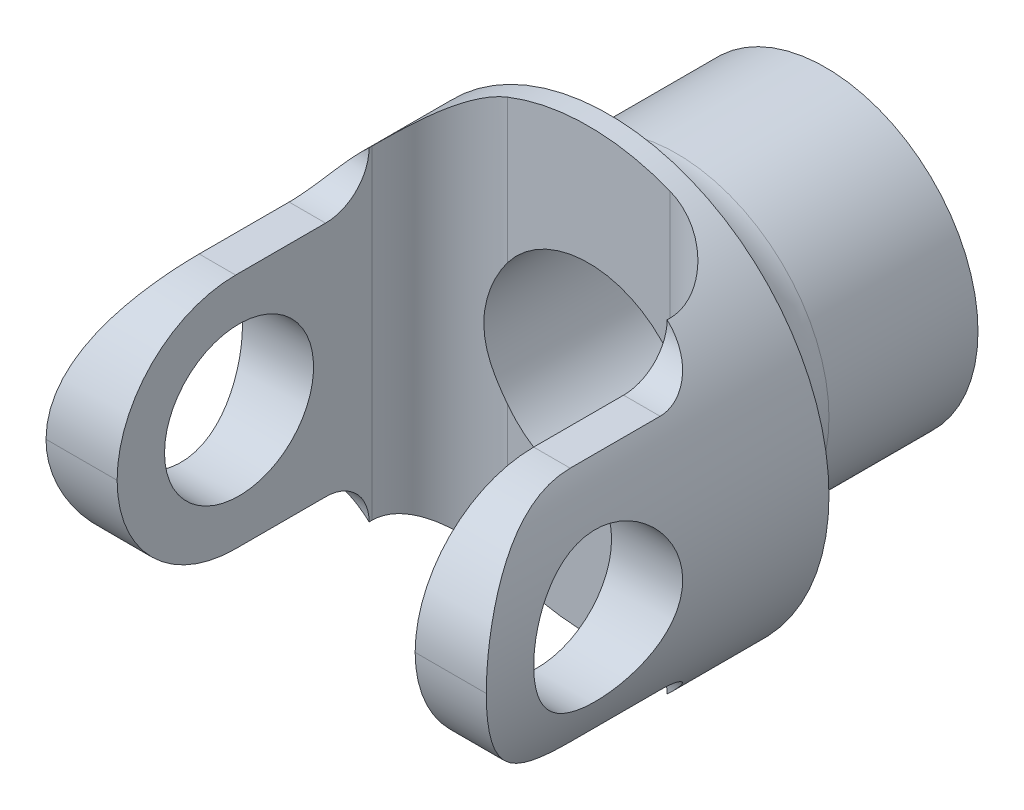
ISO-10303-21;
HEADER;
FILE_DESCRIPTION(('STEP AP214'),'2;1');
FILE_NAME('part.step','',(''),(''),'','','');
FILE_SCHEMA(('AUTOMOTIVE_DESIGN { 1 0 10303 214 1 1 1 1 }'));
ENDSEC;
DATA;
#1=APPLICATION_CONTEXT('core data for automotive mechanical design processes');
#2=APPLICATION_PROTOCOL_DEFINITION('international standard','automotive_design',2000,#1);
#3=PRODUCT_CONTEXT('',#1,'mechanical');
#4=PRODUCT('Part','Part','',(#3));
#5=PRODUCT_RELATED_PRODUCT_CATEGORY('part','',(#4));
#6=PRODUCT_DEFINITION_FORMATION('','',#4);
#7=PRODUCT_DEFINITION_CONTEXT('part definition',#1,'design');
#8=PRODUCT_DEFINITION('design','',#6,#7);
#9=PRODUCT_DEFINITION_SHAPE('','',#8);
#10=(LENGTH_UNIT() NAMED_UNIT(*) SI_UNIT(.MILLI.,.METRE.));
#11=(NAMED_UNIT(*) PLANE_ANGLE_UNIT() SI_UNIT($,.RADIAN.));
#12=(NAMED_UNIT(*) SI_UNIT($,.STERADIAN.) SOLID_ANGLE_UNIT());
#13=UNCERTAINTY_MEASURE_WITH_UNIT(LENGTH_MEASURE(1.E-05),#10,'distance_accuracy_value','');
#14=(GEOMETRIC_REPRESENTATION_CONTEXT(3) GLOBAL_UNCERTAINTY_ASSIGNED_CONTEXT((#13)) GLOBAL_UNIT_ASSIGNED_CONTEXT((#10,
#11,#12)) REPRESENTATION_CONTEXT('',''));
#15=CARTESIAN_POINT('',(0.,0.,0.));
#16=DIRECTION('',(0.,0.,1.));
#17=DIRECTION('',(1.,0.,0.));
#18=AXIS2_PLACEMENT_3D('',#15,#16,#17);
#19=CARTESIAN_POINT('',(-7.62,-25.4,-18.796));
#20=DIRECTION('',(0.,0.,-1.));
#21=DIRECTION('',(-1.,0.,0.));
#22=AXIS2_PLACEMENT_3D('',#19,#20,#21);
#23=PLANE('',#22);
#24=DIRECTION('',(0.,1.,0.));
#25=VECTOR('',#24,1.);
#26=CARTESIAN_POINT('',(-7.62,-25.4,-18.796));
#27=LINE('',#26,#25);
#28=CARTESIAN_POINT('',(-7.62,5.71500000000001,-18.796));
#29=VERTEX_POINT('',#28);
#30=CARTESIAN_POINT('',(-7.62,19.1792076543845,-18.796));
#31=VERTEX_POINT('',#30);
#32=EDGE_CURVE('E176',#29,#31,#27,.T.);
#33=ORIENTED_EDGE('',*,*,#32,.F.);
#34=CARTESIAN_POINT('',(0.,0.,-18.796));
#35=DIRECTION('',(0.,0.,-1.));
#36=DIRECTION('',(-1.,0.,0.));
#37=AXIS2_PLACEMENT_3D('',#34,#35,#36);
#38=CIRCLE('',#37,9.525);
#39=CARTESIAN_POINT('',(7.61999999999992,5.71500000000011,-18.796));
#40=VERTEX_POINT('',#39);
#41=EDGE_CURVE('E161',#40,#29,#38,.F.);
#42=ORIENTED_EDGE('',*,*,#41,.F.);
#43=DIRECTION('',(0.,1.,0.));
#44=VECTOR('',#43,1.);
#45=CARTESIAN_POINT('',(7.61999999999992,-25.4,-18.796));
#46=LINE('',#45,#44);
#47=CARTESIAN_POINT('',(7.61999999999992,19.1792076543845,-18.796));
#48=VERTEX_POINT('',#47);
#49=EDGE_CURVE('E174',#40,#48,#46,.T.);
#50=ORIENTED_EDGE('',*,*,#49,.T.);
#51=CARTESIAN_POINT('',(0.,0.,-18.796));
#52=DIRECTION('',(0.,0.,-1.));
#53=DIRECTION('',(-1.,0.,0.));
#54=AXIS2_PLACEMENT_3D('',#51,#52,#53);
#55=CIRCLE('',#54,20.6375);
#56=EDGE_CURVE('E230',#48,#31,#55,.F.);
#57=ORIENTED_EDGE('',*,*,#56,.T.);
#58=EDGE_LOOP('',(#33,#42,#50,#57));
#59=FACE_BOUND('',#58,.T.);
#60=ADVANCED_FACE('F35',(#59),#23,.F.);
#61=CARTESIAN_POINT('',(0.,0.,-41.021));
#62=DIRECTION('',(0.,0.,1.));
#63=DIRECTION('',(1.,0.,0.));
#64=AXIS2_PLACEMENT_3D('',#61,#62,#63);
#65=CYLINDRICAL_SURFACE('',#64,20.6375);
#66=DIRECTION('',(0.,0.,1.));
#67=VECTOR('',#66,1.);
#68=CARTESIAN_POINT('',(-17.390191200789,-11.1125,-41.021));
#69=LINE('',#68,#67);
#70=CARTESIAN_POINT('',(-17.390191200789,-11.1125,0.317499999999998));
#71=VERTEX_POINT('',#70);
#72=CARTESIAN_POINT('',(-17.390191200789,-11.1125,-8.11419030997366));
#73=VERTEX_POINT('',#72);
#74=EDGE_CURVE('E323',#71,#73,#69,.F.);
#75=ORIENTED_EDGE('',*,*,#74,.F.);
#76=CARTESIAN_POINT('',(-17.390191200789,-11.1125,0.317500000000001));
#77=CARTESIAN_POINT('',(-17.3901873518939,-11.1125012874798,0.461225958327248));
#78=CARTESIAN_POINT('',(-17.3919737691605,-11.1097109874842,0.604930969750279));
#79=CARTESIAN_POINT('',(-17.3990879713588,-11.0985678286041,0.892030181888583));
#80=CARTESIAN_POINT('',(-17.4044155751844,-11.0902152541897,1.03542439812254));
#81=CARTESIAN_POINT('',(-17.4256379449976,-11.0568662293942,1.46448144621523));
#82=CARTESIAN_POINT('',(-17.4467724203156,-11.0235783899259,1.74929901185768));
#83=CARTESIAN_POINT('',(-17.5020012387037,-10.9356758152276,2.31232945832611));
#84=CARTESIAN_POINT('',(-17.5360087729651,-10.8812038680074,2.5905735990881));
#85=CARTESIAN_POINT('',(-17.6157385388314,-10.7516481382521,3.14053659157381));
#86=CARTESIAN_POINT('',(-17.6614624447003,-10.6765614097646,3.41225450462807));
#87=CARTESIAN_POINT('',(-17.7629243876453,-10.5068859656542,3.94674599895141));
#88=CARTESIAN_POINT('',(-17.8186351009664,-10.4123503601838,4.20954171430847));
#89=CARTESIAN_POINT('',(-17.9384317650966,-10.2045794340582,4.72562881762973));
#90=CARTESIAN_POINT('',(-18.002517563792,-10.0913444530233,4.978920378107));
#91=CARTESIAN_POINT('',(-18.1373937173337,-9.84687105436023,5.47535595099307));
#92=CARTESIAN_POINT('',(-18.2081954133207,-9.71560200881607,5.71848176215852));
#93=CARTESIAN_POINT('',(-18.3546203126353,-9.43605930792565,6.19324177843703));
#94=CARTESIAN_POINT('',(-18.4302439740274,-9.28778403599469,6.42487488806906));
#95=CARTESIAN_POINT('',(-18.5919491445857,-8.96004100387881,6.8974493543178));
#96=CARTESIAN_POINT('',(-18.6783386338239,-8.77894593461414,7.13715803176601));
#97=CARTESIAN_POINT('',(-18.8525761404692,-8.3982500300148,7.60084036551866));
#98=CARTESIAN_POINT('',(-18.9404242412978,-8.19864813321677,7.82481311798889));
#99=CARTESIAN_POINT('',(-19.115490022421,-7.78174656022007,8.25614462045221));
#100=CARTESIAN_POINT('',(-19.2027073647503,-7.56443806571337,8.46349498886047));
#101=CARTESIAN_POINT('',(-19.374387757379,-7.1132101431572,8.86034164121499));
#102=CARTESIAN_POINT('',(-19.4588517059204,-6.87929621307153,9.04984378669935));
#103=CARTESIAN_POINT('',(-19.6298569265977,-6.37585073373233,9.42478395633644));
#104=CARTESIAN_POINT('',(-19.7159966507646,-6.10497232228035,9.60860271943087));
#105=CARTESIAN_POINT('',(-19.8804005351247,-5.54624885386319,9.95256091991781));
#106=CARTESIAN_POINT('',(-19.9586638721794,-5.25840202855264,10.1126978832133));
#107=CARTESIAN_POINT('',(-20.1049431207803,-4.66797797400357,10.4074122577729));
#108=CARTESIAN_POINT('',(-20.1729746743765,-4.36542418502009,10.5420287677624));
#109=CARTESIAN_POINT('',(-20.2968712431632,-3.74735563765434,10.7843566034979));
#110=CARTESIAN_POINT('',(-20.352739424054,-3.43184427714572,10.8920749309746));
#111=CARTESIAN_POINT('',(-20.4397879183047,-2.86104046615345,11.0585439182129));
#112=CARTESIAN_POINT('',(-20.4736955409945,-2.60776944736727,11.1228538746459));
#113=CARTESIAN_POINT('',(-20.5323642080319,-2.09634458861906,11.2336086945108));
#114=CARTESIAN_POINT('',(-20.5571273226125,-1.83819186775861,11.2800576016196));
#115=CARTESIAN_POINT('',(-20.5970508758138,-1.31763477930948,11.3547465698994));
#116=CARTESIAN_POINT('',(-20.6121787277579,-1.05521902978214,11.3829248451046));
#117=CARTESIAN_POINT('',(-20.6324248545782,-0.528542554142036,11.4205736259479));
#118=CARTESIAN_POINT('',(-20.6375383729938,-0.264281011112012,11.4300352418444));
#119=CARTESIAN_POINT('',(-20.6375,0.,11.43));
#120=B_SPLINE_CURVE_WITH_KNOTS('',3,(#76,#77,#78,#79,#80,#81,#82,#83,#84,#85,#86,#87,#88,#89,
#90,#91,#92,#93,#94,#95,#96,#97,#98,#99,#100,#101,#102,#103,#104,#105,#106,#107,#108,#109,#110,
#111,#112,#113,#114,#115,#116,#117,#118,#119),.UNSPECIFIED.,.F.,.F.,(4,2,2,2,2,2,2,2,2,2,2,2,2,
2,2,2,2,2,2,2,2,4),(0.,0.431098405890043,0.862174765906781,1.72348968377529,2.57909695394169,
3.43482655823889,4.28824967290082,5.14165728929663,5.996532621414,6.85148928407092,
7.788315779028,8.72519603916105,9.66254577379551,10.5995865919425,11.613778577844,
12.6280764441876,13.6408075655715,14.653274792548,15.4430141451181,16.2325745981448,
17.0247913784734,17.817384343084),.UNSPECIFIED.);
#121=CARTESIAN_POINT('',(-20.6375,0.,11.43));
#122=VERTEX_POINT('',#121);
#123=EDGE_CURVE('E426',#71,#122,#120,.T.);
#124=ORIENTED_EDGE('',*,*,#123,.T.);
#125=CARTESIAN_POINT('',(-20.6375,0.,11.43));
#126=CARTESIAN_POINT('',(-20.6375018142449,0.145274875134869,11.4300009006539));
#127=CARTESIAN_POINT('',(-20.6359655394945,0.290529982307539,11.4271506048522));
#128=CARTESIAN_POINT('',(-20.629837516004,0.580746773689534,11.4157646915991));
#129=CARTESIAN_POINT('',(-20.6252458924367,0.725708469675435,11.4072293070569));
#130=CARTESIAN_POINT('',(-20.6069270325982,1.15959698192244,11.3731359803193));
#131=CARTESIAN_POINT('',(-20.588655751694,1.44772217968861,11.3390908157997));
#132=CARTESIAN_POINT('',(-20.5405834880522,2.01801093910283,11.2490256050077));
#133=CARTESIAN_POINT('',(-20.5108401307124,2.30019697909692,11.1931153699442));
#134=CARTESIAN_POINT('',(-20.4405600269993,2.85814094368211,11.0599829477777));
#135=CARTESIAN_POINT('',(-20.4000225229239,3.13389841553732,10.9827592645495));
#136=CARTESIAN_POINT('',(-20.3092027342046,3.67672593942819,10.8079969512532));
#137=CARTESIAN_POINT('',(-20.2589362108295,3.94380923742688,10.7104911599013));
#138=CARTESIAN_POINT('',(-20.1497483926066,4.46831496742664,10.4960131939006));
#139=CARTESIAN_POINT('',(-20.090823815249,4.72573368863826,10.3790336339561));
#140=CARTESIAN_POINT('',(-19.9655860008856,5.22964966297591,10.1265719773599));
#141=CARTESIAN_POINT('',(-19.8992682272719,5.47614007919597,9.99107850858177));
#142=CARTESIAN_POINT('',(-19.7606440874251,5.95701260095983,9.70261097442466));
#143=CARTESIAN_POINT('',(-19.6883355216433,6.1913902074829,9.54963048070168));
#144=CARTESIAN_POINT('',(-19.534288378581,6.66207819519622,9.21653924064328));
#145=CARTESIAN_POINT('',(-19.4522424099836,6.89749203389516,9.03530352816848));
#146=CARTESIAN_POINT('',(-19.2848978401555,7.35240586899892,8.65522445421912));
#147=CARTESIAN_POINT('',(-19.1995991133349,7.57190524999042,8.45638041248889));
#148=CARTESIAN_POINT('',(-19.0276031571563,7.9942963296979,8.04191033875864));
#149=CARTESIAN_POINT('',(-18.9409046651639,8.19717190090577,7.82626839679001));
#150=CARTESIAN_POINT('',(-18.7682101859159,8.58520820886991,7.37933017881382));
#151=CARTESIAN_POINT('',(-18.682214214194,8.77036855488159,7.14803355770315));
#152=CARTESIAN_POINT('',(-18.5050344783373,9.13869335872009,6.64815593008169));
#153=CARTESIAN_POINT('',(-18.4141276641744,9.32001824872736,6.37811663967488));
#154=CARTESIAN_POINT('',(-18.2385370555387,9.65912277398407,5.82160692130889));
#155=CARTESIAN_POINT('',(-18.1538546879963,9.81689701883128,5.53513275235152));
#156=CARTESIAN_POINT('',(-17.9938828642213,10.1071260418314,4.94790921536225));
#157=CARTESIAN_POINT('',(-17.9185735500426,10.2396346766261,4.64719195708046));
#158=CARTESIAN_POINT('',(-17.7801454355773,10.4781617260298,4.03290203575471));
#159=CARTESIAN_POINT('',(-17.7170179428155,10.5841990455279,3.71933873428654));
#160=CARTESIAN_POINT('',(-17.6181889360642,10.7476871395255,3.15319228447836));
#161=CARTESIAN_POINT('',(-17.5795119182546,10.8107012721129,2.9027216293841));
#162=CARTESIAN_POINT('',(-17.512256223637,10.9193110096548,2.39673881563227));
#163=CARTESIAN_POINT('',(-17.483674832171,10.9649112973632,2.14122803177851));
#164=CARTESIAN_POINT('',(-17.4374064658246,11.0383545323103,1.62537200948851));
#165=CARTESIAN_POINT('',(-17.4197743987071,11.0661080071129,1.36500904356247));
#166=CARTESIAN_POINT('',(-17.3961282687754,11.1032074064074,0.842275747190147));
#167=CARTESIAN_POINT('',(-17.3901221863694,11.1125406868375,0.579904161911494));
#168=CARTESIAN_POINT('',(-17.390191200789,11.1125,0.317499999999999));
#169=B_SPLINE_CURVE_WITH_KNOTS('',3,(#125,#126,#127,#128,#129,#130,#131,#132,#133,#134,#135,
#136,#137,#138,#139,#140,#141,#142,#143,#144,#145,#146,#147,#148,#149,#150,#151,#152,#153,#154,
#155,#156,#157,#158,#159,#160,#161,#162,#163,#164,#165,#166,#167,#168),.UNSPECIFIED.,.F.,.F.,(4,
2,2,2,2,2,2,2,2,2,2,2,2,2,2,2,2,2,2,2,2,4),(0.,0.435749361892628,0.871480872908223,
1.7423611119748,2.60892263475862,3.47554500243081,4.3407749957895,5.20633387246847,
6.07242682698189,6.9388391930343,7.86252898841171,8.78625448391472,9.71086577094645,
10.6354974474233,11.6474425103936,12.6596188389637,13.6696128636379,14.6788835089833,
15.4615871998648,16.2440802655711,17.0304662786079,17.8173918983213),.UNSPECIFIED.);
#170=CARTESIAN_POINT('',(-17.390191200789,11.1125,0.317499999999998));
#171=VERTEX_POINT('',#170);
#172=EDGE_CURVE('E394',#122,#171,#169,.T.);
#173=ORIENTED_EDGE('',*,*,#172,.T.);
#174=DIRECTION('',(0.,0.,1.));
#175=VECTOR('',#174,1.);
#176=CARTESIAN_POINT('',(-17.390191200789,11.1125,-41.021));
#177=LINE('',#176,#175);
#178=CARTESIAN_POINT('',(-17.390191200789,11.1125,-8.11419030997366));
#179=VERTEX_POINT('',#178);
#180=EDGE_CURVE('E299',#179,#171,#177,.T.);
#181=ORIENTED_EDGE('',*,*,#180,.F.);
#182=CARTESIAN_POINT('',(-13.9699999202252,15.1903096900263,-12.192));
#183=CARTESIAN_POINT('',(-14.2235689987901,14.9570952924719,-12.1919957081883));
#184=CARTESIAN_POINT('',(-14.4714655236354,14.7173176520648,-12.1720286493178));
#185=CARTESIAN_POINT('',(-14.8308712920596,14.3520389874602,-12.1068218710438));
#186=CARTESIAN_POINT('',(-14.9485913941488,14.2293538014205,-12.0792137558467));
#187=CARTESIAN_POINT('',(-15.1792522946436,13.9830310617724,-12.0112840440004));
#188=CARTESIAN_POINT('',(-15.2921938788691,13.8593936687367,-11.9709645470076));
#189=CARTESIAN_POINT('',(-15.5817042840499,13.5347409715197,-11.847007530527));
#190=CARTESIAN_POINT('',(-15.7537638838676,13.3338180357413,-11.7520606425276));
#191=CARTESIAN_POINT('',(-16.0790437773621,12.939704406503,-11.5223033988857));
#192=CARTESIAN_POINT('',(-16.2322845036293,12.7465054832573,-11.3875368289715));
#193=CARTESIAN_POINT('',(-16.4921461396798,12.4077926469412,-11.101940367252));
#194=CARTESIAN_POINT('',(-16.6022845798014,12.2596815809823,-10.9574712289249));
#195=CARTESIAN_POINT('',(-16.7532955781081,12.0515936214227,-10.7195963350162));
#196=CARTESIAN_POINT('',(-16.8012846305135,11.9845507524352,-10.6367346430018));
#197=CARTESIAN_POINT('',(-16.8922190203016,11.856033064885,-10.4642286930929));
#198=CARTESIAN_POINT('',(-16.9351665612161,11.7945558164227,-10.3745874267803));
#199=CARTESIAN_POINT('',(-17.0160105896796,11.6776233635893,-10.1882576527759));
#200=CARTESIAN_POINT('',(-17.053868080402,11.6222151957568,-10.091522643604));
#201=CARTESIAN_POINT('',(-17.1238605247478,11.5188412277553,-9.89223487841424));
#202=CARTESIAN_POINT('',(-17.155998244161,11.4708718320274,-9.78968496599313));
#203=CARTESIAN_POINT('',(-17.2143166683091,11.3831667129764,-9.57950898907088));
#204=CARTESIAN_POINT('',(-17.240498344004,11.3434296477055,-9.47188375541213));
#205=CARTESIAN_POINT('',(-17.2867007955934,11.2728950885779,-9.25246484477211));
#206=CARTESIAN_POINT('',(-17.3067224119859,11.242096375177,-9.14067173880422));
#207=CARTESIAN_POINT('',(-17.3384230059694,11.1931334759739,-8.92757466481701));
#208=CARTESIAN_POINT('',(-17.3508146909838,11.1738967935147,-8.8266213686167));
#209=CARTESIAN_POINT('',(-17.3706293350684,11.1430687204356,-8.62307567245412));
#210=CARTESIAN_POINT('',(-17.3780527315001,11.1314766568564,-8.52048341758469));
#211=CARTESIAN_POINT('',(-17.3878831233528,11.116114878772,-8.3145153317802));
#212=CARTESIAN_POINT('',(-17.3902919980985,11.1123422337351,-8.21113980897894));
#213=CARTESIAN_POINT('',(-17.3900839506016,11.1126678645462,-8.00440666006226));
#214=CARTESIAN_POINT('',(-17.3874671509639,11.116765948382,-7.90104903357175));
#215=CARTESIAN_POINT('',(-17.3775370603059,11.1322813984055,-7.70146970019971));
#216=CARTESIAN_POINT('',(-17.3705196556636,11.1432375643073,-7.60519692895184));
#217=CARTESIAN_POINT('',(-17.3521046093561,11.1718915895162,-7.41405388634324));
#218=CARTESIAN_POINT('',(-17.3407055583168,11.1895916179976,-7.31918407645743));
#219=CARTESIAN_POINT('',(-17.3135937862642,11.231495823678,-7.13156362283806));
#220=CARTESIAN_POINT('',(-17.2978830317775,11.2556970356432,-7.0388120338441));
#221=CARTESIAN_POINT('',(-17.2622350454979,11.3102920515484,-6.85597031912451));
#222=CARTESIAN_POINT('',(-17.2422962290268,11.3406881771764,-6.76588120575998));
#223=CARTESIAN_POINT('',(-17.1756813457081,11.4415451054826,-6.49804710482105));
#224=CARTESIAN_POINT('',(-17.1225614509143,11.5211158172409,-6.32519825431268));
#225=CARTESIAN_POINT('',(-17.0005341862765,11.7004252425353,-5.99655656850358));
#226=CARTESIAN_POINT('',(-16.9316234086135,11.800168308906,-5.84076742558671));
#227=CARTESIAN_POINT('',(-16.7733214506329,12.0242398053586,-5.53679577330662));
#228=CARTESIAN_POINT('',(-16.6827321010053,12.1498974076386,-5.39022148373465));
#229=CARTESIAN_POINT('',(-16.4867347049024,12.4145504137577,-5.1209678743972));
#230=CARTESIAN_POINT('',(-16.3813182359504,12.5535533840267,-4.99830223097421));
#231=CARTESIAN_POINT('',(-16.1906963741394,12.7978229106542,-4.80951374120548));
#232=CARTESIAN_POINT('',(-16.1086563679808,12.900998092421,-4.73736842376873));
#233=CARTESIAN_POINT('',(-15.9388976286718,13.1101515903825,-4.60465887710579));
#234=CARTESIAN_POINT('',(-15.8511771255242,13.2161307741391,-4.54409828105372));
#235=CARTESIAN_POINT('',(-15.6706257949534,13.4297237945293,-4.43406445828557));
#236=CARTESIAN_POINT('',(-15.5777882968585,13.537339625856,-4.38460615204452));
#237=CARTESIAN_POINT('',(-15.387694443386,13.7530342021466,-4.29629078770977));
#238=CARTESIAN_POINT('',(-15.2904369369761,13.8611130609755,-4.25743650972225));
#239=CARTESIAN_POINT('',(-15.0570757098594,14.114889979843,-4.17777160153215));
#240=CARTESIAN_POINT('',(-14.9193651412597,14.2604172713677,-4.14110060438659));
#241=CARTESIAN_POINT('',(-14.6380702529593,14.5490193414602,-4.08443600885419));
#242=CARTESIAN_POINT('',(-14.4944839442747,14.6920932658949,-4.06444810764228));
#243=CARTESIAN_POINT('',(-14.2023141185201,14.9747132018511,-4.03961108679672));
#244=CARTESIAN_POINT('',(-14.0537248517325,15.1142548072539,-4.03478003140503));
#245=CARTESIAN_POINT('',(-13.7526099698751,15.3887510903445,-4.03889955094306));
#246=CARTESIAN_POINT('',(-13.6000843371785,15.5237057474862,-4.04785018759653));
#247=CARTESIAN_POINT('',(-13.2320526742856,15.8397796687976,-4.08418682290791));
#248=CARTESIAN_POINT('',(-13.0150565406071,16.0185106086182,-4.11737505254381));
#249=CARTESIAN_POINT('',(-12.5766244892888,16.3649957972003,-4.20514881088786));
#250=CARTESIAN_POINT('',(-12.3551865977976,16.5327450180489,-4.2597440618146));
#251=CARTESIAN_POINT('',(-11.9092445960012,16.8568192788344,-4.38837416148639));
#252=CARTESIAN_POINT('',(-11.6847372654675,17.013131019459,-4.46243119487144));
#253=CARTESIAN_POINT('',(-11.2345060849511,17.3137376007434,-4.62863589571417));
#254=CARTESIAN_POINT('',(-11.0087826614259,17.4580363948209,-4.7207775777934));
#255=CARTESIAN_POINT('',(-10.5992052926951,17.7090339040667,-4.90419433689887));
#256=CARTESIAN_POINT('',(-10.4152736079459,17.8177716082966,-4.99252204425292));
#257=CARTESIAN_POINT('',(-10.0489162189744,18.0269289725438,-5.18127815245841));
#258=CARTESIAN_POINT('',(-9.86649032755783,18.1273496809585,-5.28170502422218));
#259=CARTESIAN_POINT('',(-9.50466953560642,18.3196500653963,-5.49569799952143));
#260=CARTESIAN_POINT('',(-9.32527569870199,18.4115267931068,-5.60926860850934));
#261=CARTESIAN_POINT('',(-9.06065300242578,18.5424023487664,-5.79092837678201));
#262=CARTESIAN_POINT('',(-8.97321717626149,18.5848585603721,-5.85334399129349));
#263=CARTESIAN_POINT('',(-8.8003322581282,18.6673435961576,-5.98237483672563));
#264=CARTESIAN_POINT('',(-8.71488277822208,18.7073728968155,-6.04898923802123));
#265=CARTESIAN_POINT('',(-8.54623457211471,18.7850190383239,-6.18729684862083));
#266=CARTESIAN_POINT('',(-8.46304905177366,18.8226229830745,-6.25901352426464));
#267=CARTESIAN_POINT('',(-8.30042056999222,18.8949022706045,-6.40791518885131));
#268=CARTESIAN_POINT('',(-8.22097580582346,18.9295790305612,-6.4850974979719));
#269=CARTESIAN_POINT('',(-8.06767541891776,18.9954188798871,-6.64546450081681));
#270=CARTESIAN_POINT('',(-7.99379351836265,19.0265988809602,-6.72861680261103));
#271=CARTESIAN_POINT('',(-7.8535068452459,19.0849308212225,-6.90223555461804));
#272=CARTESIAN_POINT('',(-7.7870911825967,19.11208864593,-6.99269101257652));
#273=CARTESIAN_POINT('',(-7.67437097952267,19.1575979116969,-7.16760553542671));
#274=CARTESIAN_POINT('',(-7.62654403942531,19.1766606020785,-7.25088088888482));
#275=CARTESIAN_POINT('',(-7.54166009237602,19.2102018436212,-7.42373029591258));
#276=CARTESIAN_POINT('',(-7.50459924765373,19.2246820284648,-7.51330209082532));
#277=CARTESIAN_POINT('',(-7.44448342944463,19.2480427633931,-7.69922511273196));
#278=CARTESIAN_POINT('',(-7.42161814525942,19.2568475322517,-7.79564973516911));
#279=CARTESIAN_POINT('',(-7.39407495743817,19.2674417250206,-7.99140495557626));
#280=CARTESIAN_POINT('',(-7.38936562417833,19.2692432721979,-8.09073023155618));
#281=CARTESIAN_POINT('',(-7.39825638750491,19.2658299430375,-8.27603300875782));
#282=CARTESIAN_POINT('',(-7.4096653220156,19.2614547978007,-8.36214286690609));
#283=CARTESIAN_POINT('',(-7.44550096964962,19.2476306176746,-8.53119446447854));
#284=CARTESIAN_POINT('',(-7.46994320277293,19.2381755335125,-8.6141323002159));
#285=CARTESIAN_POINT('',(-7.54254370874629,19.2098548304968,-8.81104042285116));
#286=CARTESIAN_POINT('',(-7.59640860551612,19.1886773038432,-8.92253861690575));
#287=CARTESIAN_POINT('',(-7.71900147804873,19.1396912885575,-9.13543495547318));
#288=CARTESIAN_POINT('',(-7.78777271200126,19.1118634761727,-9.23680242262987));
#289=CARTESIAN_POINT('',(-7.93174234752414,19.0525503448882,-9.42605843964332));
#290=CARTESIAN_POINT('',(-8.00651522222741,19.0212845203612,-9.5143472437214));
#291=CARTESIAN_POINT('',(-8.16220373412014,18.954999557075,-9.68388274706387));
#292=CARTESIAN_POINT('',(-8.2431251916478,18.9199768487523,-9.76512261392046));
#293=CARTESIAN_POINT('',(-8.40939867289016,18.8466628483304,-9.92170149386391));
#294=CARTESIAN_POINT('',(-8.49475975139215,18.8083647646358,-9.99702759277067));
#295=CARTESIAN_POINT('',(-8.66857416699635,18.7288913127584,-10.1424498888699));
#296=CARTESIAN_POINT('',(-8.75702866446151,18.6877148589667,-10.21254409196));
#297=CARTESIAN_POINT('',(-8.94351946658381,18.5992303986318,-10.3536739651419));
#298=CARTESIAN_POINT('',(-9.04174638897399,18.551696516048,-10.4243148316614));
#299=CARTESIAN_POINT('',(-9.24008617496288,18.4537115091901,-10.5607771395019));
#300=CARTESIAN_POINT('',(-9.340199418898,18.4032597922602,-10.6265975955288));
#301=CARTESIAN_POINT('',(-9.64268161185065,18.2476425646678,-10.8175758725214));
#302=CARTESIAN_POINT('',(-9.84707048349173,18.1382727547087,-10.9361601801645));
#303=CARTESIAN_POINT('',(-10.2585694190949,17.9087641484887,-11.1578695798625));
#304=CARTESIAN_POINT('',(-10.4656831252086,17.7886093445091,-11.2609710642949));
#305=CARTESIAN_POINT('',(-10.8805670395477,17.5379136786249,-11.4521735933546));
#306=CARTESIAN_POINT('',(-11.0883372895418,17.4073721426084,-11.5402736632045));
#307=CARTESIAN_POINT('',(-11.5251537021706,17.1216930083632,-11.7098450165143));
#308=CARTESIAN_POINT('',(-11.7541169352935,16.9654154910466,-11.78961968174));
#309=CARTESIAN_POINT('',(-12.209550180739,16.6406596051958,-11.9294593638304));
#310=CARTESIAN_POINT('',(-12.4360193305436,16.4721771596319,-11.9895177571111));
#311=CARTESIAN_POINT('',(-12.8841288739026,16.1240760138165,-12.0877541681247));
#312=CARTESIAN_POINT('',(-13.1057813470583,15.9444909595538,-12.1259950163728));
#313=CARTESIAN_POINT('',(-13.5429359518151,15.5748918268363,-12.1781112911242));
#314=CARTESIAN_POINT('',(-13.7584422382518,15.384885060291,-12.1920035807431));
#315=CARTESIAN_POINT('',(-13.9699999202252,15.1903096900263,-12.192));
#316=B_SPLINE_CURVE_WITH_KNOTS('',3,(#182,#183,#184,#185,#186,#187,#188,#189,#190,#191,#192,
#193,#194,#195,#196,#197,#198,#199,#200,#201,#202,#203,#204,#205,#206,#207,#208,#209,#210,#211,
#212,#213,#214,#215,#216,#217,#218,#219,#220,#221,#222,#223,#224,#225,#226,#227,#228,#229,#230,
#231,#232,#233,#234,#235,#236,#237,#238,#239,#240,#241,#242,#243,#244,#245,#246,#247,#248,#249,
#250,#251,#252,#253,#254,#255,#256,#257,#258,#259,#260,#261,#262,#263,#264,#265,#266,#267,#268,
#269,#270,#271,#272,#273,#274,#275,#276,#277,#278,#279,#280,#281,#282,#283,#284,#285,#286,#287,
#288,#289,#290,#291,#292,#293,#294,#295,#296,#297,#298,#299,#300,#301,#302,#303,#304,#305,#306,
#307,#308,#309,#310,#311,#312,#313,#314,#315),.UNSPECIFIED.,.T.,.F.,(4,2,2,2,2,2,2,2,2,2,2,2,2,
2,2,2,2,2,2,2,2,2,2,2,2,2,2,2,2,2,2,2,2,2,2,2,2,2,2,2,2,2,2,2,2,2,2,2,2,2,2,2,2,2,2,2,2,2,2,2,2,
2,2,2,2,2,4),(0.,1.03277965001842,1.54908936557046,2.06531384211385,2.90523016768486,
3.74422633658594,4.44421681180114,4.79452349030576,5.14467648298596,5.49737544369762,
5.84990339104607,6.20237382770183,6.55479615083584,6.86493755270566,7.17505164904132,
7.48504950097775,7.79503979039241,8.08614148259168,8.37733688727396,8.66839970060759,
8.95957179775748,9.5494757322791,10.1395070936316,10.7767888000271,11.4144339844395,
11.864677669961,12.3150623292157,12.7660486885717,13.2171531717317,13.8272961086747,
14.4376473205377,15.0487256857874,15.6598067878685,16.5078158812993,17.356210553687,
18.2055765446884,19.0546618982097,19.7478428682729,20.4409363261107,21.1342680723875,
21.4807139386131,21.8270915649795,22.1751805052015,22.5230999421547,22.8692566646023,
23.214901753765,23.507923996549,23.8008416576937,24.0975936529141,24.3938317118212,
24.6534536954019,24.9133855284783,25.2881172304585,25.6639513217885,26.0229610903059,
26.3823150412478,26.7424330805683,27.102687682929,27.492506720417,27.8824052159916,
28.6626892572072,29.4441512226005,30.2256639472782,31.0901427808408,31.954911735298,
32.817177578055,33.67884600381),.UNSPECIFIED.);
#317=CARTESIAN_POINT('',(-13.97,15.1903096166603,-12.192));
#318=VERTEX_POINT('',#317);
#319=EDGE_CURVE('E186',#318,#179,#316,.T.);
#320=ORIENTED_EDGE('',*,*,#319,.F.);
#321=DIRECTION('',(0.,0.,1.));
#322=VECTOR('',#321,1.);
#323=CARTESIAN_POINT('',(-13.97,15.1903096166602,-41.021));
#324=LINE('',#323,#322);
#325=CARTESIAN_POINT('',(-13.97,15.1903096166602,-12.446));
#326=VERTEX_POINT('',#325);
#327=EDGE_CURVE('E198',#326,#318,#324,.T.);
#328=ORIENTED_EDGE('',*,*,#327,.F.);
#329=CARTESIAN_POINT('',(-7.62,19.1792076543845,-18.796));
#330=CARTESIAN_POINT('',(-7.81704927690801,19.1009516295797,-18.7960109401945));
#331=CARTESIAN_POINT('',(-8.01280386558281,19.0196298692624,-18.7868298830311));
#332=CARTESIAN_POINT('',(-8.40023754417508,18.8517009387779,-18.7508798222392));
#333=CARTESIAN_POINT('',(-8.59191940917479,18.7650975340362,-18.7241232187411));
#334=CARTESIAN_POINT('',(-8.96915162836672,18.5877391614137,-18.6539742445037));
#335=CARTESIAN_POINT('',(-9.15472571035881,18.4970046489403,-18.6106573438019));
#336=CARTESIAN_POINT('',(-9.51956677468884,18.3119130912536,-18.5081834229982));
#337=CARTESIAN_POINT('',(-9.69883263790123,18.2175554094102,-18.4490236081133));
#338=CARTESIAN_POINT('',(-10.224731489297,17.930974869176,-18.2492899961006));
#339=CARTESIAN_POINT('',(-10.5608147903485,17.7346038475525,-18.0862028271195));
#340=CARTESIAN_POINT('',(-11.1990515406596,17.3386600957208,-17.7044826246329));
#341=CARTESIAN_POINT('',(-11.5011192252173,17.1390806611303,-17.4857135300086));
#342=CARTESIAN_POINT('',(-11.9354171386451,16.837070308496,-17.1086646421));
#343=CARTESIAN_POINT('',(-12.08200343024,16.7320632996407,-16.9686577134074));
#344=CARTESIAN_POINT('',(-12.3624517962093,16.525931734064,-16.6736567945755));
#345=CARTESIAN_POINT('',(-12.4963111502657,16.424808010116,-16.518659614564));
#346=CARTESIAN_POINT('',(-12.7498162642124,16.2288085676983,-16.1943003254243));
#347=CARTESIAN_POINT('',(-12.8694875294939,16.1339217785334,-16.0249649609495));
#348=CARTESIAN_POINT('',(-13.093355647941,15.9527795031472,-15.6722267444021));
#349=CARTESIAN_POINT('',(-13.1975616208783,15.866518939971,-15.4888322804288));
#350=CARTESIAN_POINT('',(-13.4196702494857,15.6794824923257,-15.0470305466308));
#351=CARTESIAN_POINT('',(-13.5312055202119,15.5829559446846,-14.7834626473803));
#352=CARTESIAN_POINT('',(-13.6721493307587,15.4590640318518,-14.3733996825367));
#353=CARTESIAN_POINT('',(-13.714706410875,15.421278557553,-14.2344143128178));
#354=CARTESIAN_POINT('',(-13.7905371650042,15.3535033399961,-13.9520962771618));
#355=CARTESIAN_POINT('',(-13.8238132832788,15.323511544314,-13.8087647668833));
#356=CARTESIAN_POINT('',(-13.8908504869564,15.2628132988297,-13.4655925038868));
#357=CARTESIAN_POINT('',(-13.9203625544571,15.2358352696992,-13.2642067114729));
#358=CARTESIAN_POINT('',(-13.9500549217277,15.2086334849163,-12.9592561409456));
#359=CARTESIAN_POINT('',(-13.9575233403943,15.2017767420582,-12.8569042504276));
#360=CARTESIAN_POINT('',(-13.9674986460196,15.1926104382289,-12.6517133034));
#361=CARTESIAN_POINT('',(-13.970003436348,15.1903027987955,-12.5488740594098));
#362=CARTESIAN_POINT('',(-13.97,15.1903096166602,-12.446));
#363=B_SPLINE_CURVE_WITH_KNOTS('',3,(#329,#330,#331,#332,#333,#334,#335,#336,#337,#338,#339,
#340,#341,#342,#343,#344,#345,#346,#347,#348,#349,#350,#351,#352,#353,#354,#355,#356,#357,#358,
#359,#360,#361,#362),.UNSPECIFIED.,.F.,.F.,(4,2,2,2,2,2,2,2,2,2,2,2,2,2,2,2,4),(0.,
0.635728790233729,1.27100953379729,1.90342898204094,2.53596006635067,3.79652851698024,
5.06020729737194,5.74433537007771,6.42860934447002,7.11163394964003,7.79425416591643,
8.6963355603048,9.1464289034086,9.59640359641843,10.2104832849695,10.5188512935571,
10.8273495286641),.UNSPECIFIED.);
#364=EDGE_CURVE('E235',#31,#326,#363,.T.);
#365=ORIENTED_EDGE('',*,*,#364,.F.);
#366=ORIENTED_EDGE('',*,*,#56,.F.);
#367=CARTESIAN_POINT('',(13.97,15.1903096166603,-12.446));
#368=CARTESIAN_POINT('',(13.9700390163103,15.1902527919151,-12.5964873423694));
#369=CARTESIAN_POINT('',(13.9646523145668,15.1952273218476,-12.7469400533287));
#370=CARTESIAN_POINT('',(13.9433284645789,15.2148077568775,-13.0463164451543));
#371=CARTESIAN_POINT('',(13.9274020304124,15.2294038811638,-13.1952415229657));
#372=CARTESIAN_POINT('',(13.8855005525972,15.2676136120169,-13.4889978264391));
#373=CARTESIAN_POINT('',(13.8596233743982,15.2911393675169,-13.6338546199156));
#374=CARTESIAN_POINT('',(13.798304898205,15.3464948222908,-13.919922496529));
#375=CARTESIAN_POINT('',(13.7628616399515,15.3783262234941,-14.0611328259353));
#376=CARTESIAN_POINT('',(13.6831508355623,15.4492916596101,-14.3384674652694));
#377=CARTESIAN_POINT('',(13.6389208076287,15.488394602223,-14.474610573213));
#378=CARTESIAN_POINT('',(13.5421470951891,15.5730794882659,-14.7418428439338));
#379=CARTESIAN_POINT('',(13.4896003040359,15.6186638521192,-14.8729300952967));
#380=CARTESIAN_POINT('',(13.3200797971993,15.7640090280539,-15.2585600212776));
#381=CARTESIAN_POINT('',(13.1913870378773,15.8722154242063,-15.504922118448));
#382=CARTESIAN_POINT('',(12.9495085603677,16.06963965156,-15.9037486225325));
#383=CARTESIAN_POINT('',(12.8430435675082,16.1549712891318,-16.0623912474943));
#384=CARTESIAN_POINT('',(12.6180172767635,16.3313336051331,-16.36750734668));
#385=CARTESIAN_POINT('',(12.4994556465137,16.4223644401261,-16.513980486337));
#386=CARTESIAN_POINT('',(12.2511003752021,16.6084636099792,-16.7946295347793));
#387=CARTESIAN_POINT('',(12.1212933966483,16.7035366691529,-16.9287904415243));
#388=CARTESIAN_POINT('',(11.8513980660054,16.8961015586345,-17.1843862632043));
#389=CARTESIAN_POINT('',(11.7113106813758,16.9935931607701,-17.3058223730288));
#390=CARTESIAN_POINT('',(11.4196292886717,17.1909829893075,-17.5372113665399));
#391=CARTESIAN_POINT('',(11.2679067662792,17.2908959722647,-17.646989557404));
#392=CARTESIAN_POINT('',(10.9553234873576,17.4906172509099,-17.8527668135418));
#393=CARTESIAN_POINT('',(10.794462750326,17.5904255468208,-17.9487659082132));
#394=CARTESIAN_POINT('',(10.4645458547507,17.7886668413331,-18.1263255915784));
#395=CARTESIAN_POINT('',(10.2955022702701,17.8871016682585,-18.2079074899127));
#396=CARTESIAN_POINT('',(9.94982500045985,18.0816674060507,-18.3561402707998));
#397=CARTESIAN_POINT('',(9.77319518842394,18.1777994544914,-18.4227986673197));
#398=CARTESIAN_POINT('',(9.43726967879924,18.3541646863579,-18.5326192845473));
#399=CARTESIAN_POINT('',(9.27882208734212,18.4348023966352,-18.5777329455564));
#400=CARTESIAN_POINT('',(8.95750089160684,18.5930539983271,-18.6557438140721));
#401=CARTESIAN_POINT('',(8.7946282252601,18.6706685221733,-18.6886435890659));
#402=CARTESIAN_POINT('',(8.46475406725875,18.8225221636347,-18.7417811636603));
#403=CARTESIAN_POINT('',(8.29774309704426,18.8967521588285,-18.7619864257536));
#404=CARTESIAN_POINT('',(7.96080775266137,19.0411596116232,-18.7891033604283));
#405=CARTESIAN_POINT('',(7.7908817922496,19.1113347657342,-18.7960075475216));
#406=CARTESIAN_POINT('',(7.61999999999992,19.1792076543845,-18.796));
#407=B_SPLINE_CURVE_WITH_KNOTS('',3,(#367,#368,#369,#370,#371,#372,#373,#374,#375,#376,#377,
#378,#379,#380,#381,#382,#383,#384,#385,#386,#387,#388,#389,#390,#391,#392,#393,#394,#395,#396,
#397,#398,#399,#400,#401,#402,#403,#404,#405,#406),.UNSPECIFIED.,.F.,.F.,(4,2,2,2,2,2,2,2,2,2,2,
2,2,2,2,2,2,2,2,4),(0.,0.451228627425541,0.901999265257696,1.34844550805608,1.7949833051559,
2.23965391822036,2.68449102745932,3.57591841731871,4.20296586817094,4.83003055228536,
5.45784942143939,6.08560928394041,6.72173904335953,7.35786744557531,7.99304759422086,
8.62790720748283,9.17771018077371,9.72739751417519,10.2784880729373,10.8298886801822),.UNSPECIFIED.);
#408=CARTESIAN_POINT('',(13.97,15.1903096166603,-12.446));
#409=VERTEX_POINT('',#408);
#410=EDGE_CURVE('E181',#409,#48,#407,.T.);
#411=ORIENTED_EDGE('',*,*,#410,.F.);
#412=DIRECTION('',(0.,0.,1.));
#413=VECTOR('',#412,1.);
#414=CARTESIAN_POINT('',(13.97,15.1903096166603,-41.021));
#415=LINE('',#414,#413);
#416=CARTESIAN_POINT('',(13.97,15.1903096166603,-12.192));
#417=VERTEX_POINT('',#416);
#418=EDGE_CURVE('E195',#417,#409,#415,.F.);
#419=ORIENTED_EDGE('',*,*,#418,.F.);
#420=CARTESIAN_POINT('',(13.9699999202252,15.1903096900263,-12.192));
#421=CARTESIAN_POINT('',(13.7795781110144,15.3654324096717,-12.1920013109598));
#422=CARTESIAN_POINT('',(13.5858515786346,15.5369712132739,-12.180735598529));
#423=CARTESIAN_POINT('',(13.1933606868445,15.8716170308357,-12.1382202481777));
#424=CARTESIAN_POINT('',(12.9945945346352,16.0347209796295,-12.1069634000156));
#425=CARTESIAN_POINT('',(12.5933112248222,16.3517685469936,-12.0265176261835));
#426=CARTESIAN_POINT('',(12.3907924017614,16.5057079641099,-11.9773205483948));
#427=CARTESIAN_POINT('',(11.9833338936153,16.8038641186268,-11.8625884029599));
#428=CARTESIAN_POINT('',(11.7783946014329,16.9480824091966,-11.7970559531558));
#429=CARTESIAN_POINT('',(11.3586411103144,17.2323697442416,-11.6476562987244));
#430=CARTESIAN_POINT('',(11.1437715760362,17.3720148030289,-11.5631383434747));
#431=CARTESIAN_POINT('',(10.7139910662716,17.6403235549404,-11.3780141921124));
#432=CARTESIAN_POINT('',(10.4990801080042,17.7689828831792,-11.2774016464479));
#433=CARTESIAN_POINT('',(10.0706097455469,18.0152801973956,-11.0595600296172));
#434=CARTESIAN_POINT('',(9.85705385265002,18.1328958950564,-10.9422985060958));
#435=CARTESIAN_POINT('',(9.54023637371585,18.3003988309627,-10.7529295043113));
#436=CARTESIAN_POINT('',(9.43524705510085,18.3547316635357,-10.6875816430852));
#437=CARTESIAN_POINT('',(9.22691641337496,18.4603369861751,-10.5519854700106));
#438=CARTESIAN_POINT('',(9.12357482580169,18.5116099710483,-10.4817379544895));
#439=CARTESIAN_POINT('',(8.91109076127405,18.6148838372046,-10.330020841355));
#440=CARTESIAN_POINT('',(8.80213786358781,18.6666202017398,-10.2481030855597));
#441=CARTESIAN_POINT('',(8.5881870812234,18.7660156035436,-10.077006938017));
#442=CARTESIAN_POINT('',(8.48318728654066,18.8136766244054,-9.98783212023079));
#443=CARTESIAN_POINT('',(8.27967280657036,18.9041195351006,-9.8014423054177));
#444=CARTESIAN_POINT('',(8.18112001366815,18.9469314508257,-9.70428404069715));
#445=CARTESIAN_POINT('',(7.99292895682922,19.027082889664,-9.49974448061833));
#446=CARTESIAN_POINT('',(7.90327373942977,19.0644328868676,-9.39238342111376));
#447=CARTESIAN_POINT('',(7.76173940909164,19.122392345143,-9.19787268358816));
#448=CARTESIAN_POINT('',(7.70640923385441,19.1447278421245,-9.11378329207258));
#449=CARTESIAN_POINT('',(7.6057878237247,19.1849244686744,-8.93860471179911));
#450=CARTESIAN_POINT('',(7.56049997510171,19.2027840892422,-8.84751317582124));
#451=CARTESIAN_POINT('',(7.48338105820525,19.2329710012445,-8.65715788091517));
#452=CARTESIAN_POINT('',(7.45175277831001,19.2452150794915,-8.55779547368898));
#453=CARTESIAN_POINT('',(7.40746362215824,19.2623077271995,-8.35437502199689));
#454=CARTESIAN_POINT('',(7.39475182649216,19.2671761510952,-8.25033036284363));
#455=CARTESIAN_POINT('',(7.3907530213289,19.2687094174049,-8.05504981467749));
#456=CARTESIAN_POINT('',(7.39694745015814,19.2663386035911,-7.96386732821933));
#457=CARTESIAN_POINT('',(7.42449045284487,19.255740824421,-7.78414279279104));
#458=CARTESIAN_POINT('',(7.44585935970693,19.247506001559,-7.69560445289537));
#459=CARTESIAN_POINT('',(7.50902927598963,19.2229630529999,-7.49881473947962));
#460=CARTESIAN_POINT('',(7.55490998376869,19.2050260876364,-7.39210790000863));
#461=CARTESIAN_POINT('',(7.66128292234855,19.1628393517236,-7.18762837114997));
#462=CARTESIAN_POINT('',(7.72181126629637,19.1385739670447,-7.08987859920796));
#463=CARTESIAN_POINT('',(7.84732128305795,19.0874350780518,-6.91048620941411));
#464=CARTESIAN_POINT('',(7.9115290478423,19.0609393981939,-6.82818006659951));
#465=CARTESIAN_POINT('',(8.04585129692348,19.0046308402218,-6.66969550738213));
#466=CARTESIAN_POINT('',(8.1159710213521,18.9748150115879,-6.59352264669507));
#467=CARTESIAN_POINT('',(8.26056959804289,18.912313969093,-6.44637226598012));
#468=CARTESIAN_POINT('',(8.33505798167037,18.8796223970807,-6.37540692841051));
#469=CARTESIAN_POINT('',(8.48714791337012,18.8117428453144,-6.23812619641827));
#470=CARTESIAN_POINT('',(8.56475066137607,18.7765538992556,-6.17181262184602));
#471=CARTESIAN_POINT('',(8.73021488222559,18.700237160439,-6.03680046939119));
#472=CARTESIAN_POINT('',(8.81832035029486,18.6588686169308,-5.96853850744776));
#473=CARTESIAN_POINT('',(8.99658512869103,18.5735737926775,-5.83642164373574));
#474=CARTESIAN_POINT('',(9.08674488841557,18.5296469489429,-5.77256771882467));
#475=CARTESIAN_POINT('',(9.35960713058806,18.3941661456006,-5.58686211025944));
#476=CARTESIAN_POINT('',(9.5445736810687,18.2989664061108,-5.47096100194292));
#477=CARTESIAN_POINT('',(9.91782020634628,18.0993968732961,-5.25279558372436));
#478=CARTESIAN_POINT('',(10.1061037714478,17.9950165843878,-5.15054722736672));
#479=CARTESIAN_POINT('',(10.4841036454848,17.7774446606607,-4.95883275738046));
#480=CARTESIAN_POINT('',(10.6738201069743,17.6642520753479,-4.86936802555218));
#481=CARTESIAN_POINT('',(11.0749845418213,17.4158814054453,-4.69350717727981));
#482=CARTESIAN_POINT('',(11.2864518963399,17.2796666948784,-4.6086153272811));
#483=CARTESIAN_POINT('',(11.7082337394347,16.9967108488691,-4.45476732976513));
#484=CARTESIAN_POINT('',(11.9185479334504,16.8499671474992,-4.3858150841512));
#485=CARTESIAN_POINT('',(12.336370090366,16.5465083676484,-4.26505015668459));
#486=CARTESIAN_POINT('',(12.543882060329,16.3898098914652,-4.21320978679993));
#487=CARTESIAN_POINT('',(12.9551178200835,16.0667245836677,-4.12817495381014));
#488=CARTESIAN_POINT('',(13.1588428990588,15.9003411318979,-4.0949740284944));
#489=CARTESIAN_POINT('',(13.5099677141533,15.6021134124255,-4.05519277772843));
#490=CARTESIAN_POINT('',(13.6585233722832,15.4722382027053,-4.04399132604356));
#491=CARTESIAN_POINT('',(13.9520919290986,15.2080412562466,-4.03427694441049));
#492=CARTESIAN_POINT('',(14.0971048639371,15.073719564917,-4.03576388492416));
#493=CARTESIAN_POINT('',(14.3827012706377,14.8014585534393,-4.05267468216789));
#494=CARTESIAN_POINT('',(14.523288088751,14.6635221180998,-4.06808773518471));
#495=CARTESIAN_POINT('',(14.7991835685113,14.3850282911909,-4.11419322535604));
#496=CARTESIAN_POINT('',(14.9344936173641,14.244471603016,-4.14488161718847));
#497=CARTESIAN_POINT('',(15.2694529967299,13.8866080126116,-4.24386887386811));
#498=CARTESIAN_POINT('',(15.4649398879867,13.6683377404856,-4.32349681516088));
#499=CARTESIAN_POINT('',(15.8364444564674,13.2361035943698,-4.52719351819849));
#500=CARTESIAN_POINT('',(16.0124893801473,13.0221340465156,-4.65119902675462));
#501=CARTESIAN_POINT('',(16.3077377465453,12.6494685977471,-4.91821464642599));
#502=CARTESIAN_POINT('',(16.4313077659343,12.4881855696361,-5.05267337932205));
#503=CARTESIAN_POINT('',(16.6024212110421,12.2586789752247,-5.27771402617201));
#504=CARTESIAN_POINT('',(16.6571071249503,12.1842152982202,-5.35666102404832));
#505=CARTESIAN_POINT('',(16.7613646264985,12.0403872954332,-5.52217897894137));
#506=CARTESIAN_POINT('',(16.8109384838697,11.9710207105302,-5.60874652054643));
#507=CARTESIAN_POINT('',(16.9050056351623,11.8378166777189,-5.78995400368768));
#508=CARTESIAN_POINT('',(16.949453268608,11.7740299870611,-5.8846550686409));
#509=CARTESIAN_POINT('',(17.0324170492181,11.6536910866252,-6.08094094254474));
#510=CARTESIAN_POINT('',(17.0709362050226,11.5971352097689,-6.18252222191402));
#511=CARTESIAN_POINT('',(17.1417411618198,11.4922201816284,-6.39187469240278));
#512=CARTESIAN_POINT('',(17.1740286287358,11.4438588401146,-6.49964421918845));
#513=CARTESIAN_POINT('',(17.2321054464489,11.3562192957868,-6.72049407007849));
#514=CARTESIAN_POINT('',(17.2578958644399,11.3169396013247,-6.83357351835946));
#515=CARTESIAN_POINT('',(17.2997723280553,11.2528017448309,-7.04862591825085));
#516=CARTESIAN_POINT('',(17.3166931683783,11.2267198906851,-7.1500736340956));
#517=CARTESIAN_POINT('',(17.3453791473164,11.1823489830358,-7.35537053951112));
#518=CARTESIAN_POINT('',(17.3571448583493,11.1640590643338,-7.45921946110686));
#519=CARTESIAN_POINT('',(17.3754404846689,11.1355629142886,-7.66843027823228));
#520=CARTESIAN_POINT('',(17.3819726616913,11.1253531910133,-7.7737915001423));
#521=CARTESIAN_POINT('',(17.3897667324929,11.1131666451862,-7.98518258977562));
#522=CARTESIAN_POINT('',(17.3910288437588,11.1111894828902,-8.09121242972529));
#523=CARTESIAN_POINT('',(17.3883838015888,11.1153280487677,-8.29470937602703));
#524=CARTESIAN_POINT('',(17.3848747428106,11.1208205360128,-8.39219513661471));
#525=CARTESIAN_POINT('',(17.3733937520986,11.1387481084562,-8.58629375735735));
#526=CARTESIAN_POINT('',(17.3654204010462,11.1511854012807,-8.68290633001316));
#527=CARTESIAN_POINT('',(17.3450594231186,11.1828293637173,-8.8744895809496));
#528=CARTESIAN_POINT('',(17.332674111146,11.2020324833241,-8.96946109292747));
#529=CARTESIAN_POINT('',(17.3035527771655,11.246963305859,-9.15720156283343));
#530=CARTESIAN_POINT('',(17.2868151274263,11.2726934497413,-9.24996968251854));
#531=CARTESIAN_POINT('',(17.2490814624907,11.3303477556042,-9.43267359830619));
#532=CARTESIAN_POINT('',(17.2280854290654,11.3622719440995,-9.52260938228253));
#533=CARTESIAN_POINT('',(17.1819520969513,11.4319146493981,-9.69912471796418));
#534=CARTESIAN_POINT('',(17.1568133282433,11.4696352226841,-9.78570306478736));
#535=CARTESIAN_POINT('',(17.0753856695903,11.5908188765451,-10.0396223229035));
#536=CARTESIAN_POINT('',(17.013055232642,11.6823507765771,-10.201293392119));
#537=CARTESIAN_POINT('',(16.8689808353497,11.8895247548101,-10.516551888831));
#538=CARTESIAN_POINT('',(16.7862135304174,12.0063739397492,-10.6688653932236));
#539=CARTESIAN_POINT('',(16.6057123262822,12.254807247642,-10.9508604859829));
#540=CARTESIAN_POINT('',(16.5079729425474,12.3863967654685,-11.0805337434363));
#541=CARTESIAN_POINT('',(16.285388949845,12.6779516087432,-11.3326658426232));
#542=CARTESIAN_POINT('',(16.1586665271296,12.8393503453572,-11.4517927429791));
#543=CARTESIAN_POINT('',(15.8911330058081,13.1690324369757,-11.6611847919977));
#544=CARTESIAN_POINT('',(15.7503118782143,13.3373206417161,-11.7514292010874));
#545=CARTESIAN_POINT('',(15.4808312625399,13.6486496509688,-11.8925686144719));
#546=CARTESIAN_POINT('',(15.353869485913,13.7913882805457,-11.9474613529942));
#547=CARTESIAN_POINT('',(15.0930600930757,14.0763368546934,-12.0397522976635));
#548=CARTESIAN_POINT('',(14.959208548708,14.2185464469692,-12.0771403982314));
#549=CARTESIAN_POINT('',(14.6854910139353,14.501088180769,-12.1359291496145));
#550=CARTESIAN_POINT('',(14.5456110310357,14.6414148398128,-12.1572902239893));
#551=CARTESIAN_POINT('',(14.2611395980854,14.9186383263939,-12.1853247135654));
#552=CARTESIAN_POINT('',(14.1165484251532,15.0555353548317,-12.1919989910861));
#553=CARTESIAN_POINT('',(13.9699999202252,15.1903096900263,-12.192));
#554=B_SPLINE_CURVE_WITH_KNOTS('',3,(#420,#421,#422,#423,#424,#425,#426,#427,#428,#429,#430,
#431,#432,#433,#434,#435,#436,#437,#438,#439,#440,#441,#442,#443,#444,#445,#446,#447,#448,#449,
#450,#451,#452,#453,#454,#455,#456,#457,#458,#459,#460,#461,#462,#463,#464,#465,#466,#467,#468,
#469,#470,#471,#472,#473,#474,#475,#476,#477,#478,#479,#480,#481,#482,#483,#484,#485,#486,#487,
#488,#489,#490,#491,#492,#493,#494,#495,#496,#497,#498,#499,#500,#501,#502,#503,#504,#505,#506,
#507,#508,#509,#510,#511,#512,#513,#514,#515,#516,#517,#518,#519,#520,#521,#522,#523,#524,#525,
#526,#527,#528,#529,#530,#531,#532,#533,#534,#535,#536,#537,#538,#539,#540,#541,#542,#543,#544,
#545,#546,#547,#548,#549,#550,#551,#552,#553),.UNSPECIFIED.,.T.,.F.,(4,2,2,2,2,2,2,2,2,2,2,2,2,
2,2,2,2,2,2,2,2,2,2,2,2,2,2,2,2,2,2,2,2,2,2,2,2,2,2,2,2,2,2,2,2,2,2,2,2,2,2,2,2,2,2,2,2,2,2,2,2,
2,2,2,2,2,4),(0.,0.775900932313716,1.5520818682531,2.32861594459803,3.10502565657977,
3.91382040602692,4.72293502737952,5.53364900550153,5.93876709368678,6.34381949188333,
6.78098210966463,7.21793072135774,7.65200577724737,8.08523719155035,8.39394592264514,
8.70275859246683,9.01601021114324,9.32841708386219,9.60110291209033,9.87415481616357,
10.2247703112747,10.5762592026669,10.8988834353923,11.2217966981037,11.5454427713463,
11.8692147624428,12.2257181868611,12.5823003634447,13.2959470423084,14.0104204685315,
14.7249710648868,15.5207292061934,16.3166819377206,17.111340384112,17.9057231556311,
18.4982117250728,19.0906942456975,19.6827175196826,20.2745840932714,21.1820279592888,
22.0881835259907,22.8158939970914,23.1800817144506,23.5441070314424,23.911158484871,
24.2780230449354,24.6447893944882,25.0114954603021,25.3293883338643,25.6472459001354,
25.9649660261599,26.2826730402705,26.5754346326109,26.8682893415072,27.160990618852,
27.4538015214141,27.74661367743,28.0395299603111,28.6248991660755,29.2496173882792,
29.8745650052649,30.5838020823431,31.2935473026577,31.8889057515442,32.4846074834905,
33.0817754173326,33.6789082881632),.UNSPECIFIED.);
#555=CARTESIAN_POINT('',(17.390191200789,11.1125,-8.11419030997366));
#556=VERTEX_POINT('',#555);
#557=EDGE_CURVE('E266',#556,#417,#554,.T.);
#558=ORIENTED_EDGE('',*,*,#557,.F.);
#559=DIRECTION('',(0.,0.,1.));
#560=VECTOR('',#559,1.);
#561=CARTESIAN_POINT('',(17.390191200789,11.1125,-41.021));
#562=LINE('',#561,#560);
#563=CARTESIAN_POINT('',(17.390191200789,11.1125,0.317499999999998));
#564=VERTEX_POINT('',#563);
#565=EDGE_CURVE('E293',#564,#556,#562,.F.);
#566=ORIENTED_EDGE('',*,*,#565,.F.);
#567=CARTESIAN_POINT('',(17.390191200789,11.1125,0.317499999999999));
#568=CARTESIAN_POINT('',(17.3901873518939,11.1125012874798,0.461225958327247));
#569=CARTESIAN_POINT('',(17.3919737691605,11.1097109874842,0.604930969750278));
#570=CARTESIAN_POINT('',(17.3990879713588,11.0985678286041,0.892030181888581));
#571=CARTESIAN_POINT('',(17.4044155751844,11.0902152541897,1.03542439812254));
#572=CARTESIAN_POINT('',(17.4256379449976,11.0568662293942,1.46448144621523));
#573=CARTESIAN_POINT('',(17.4467724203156,11.0235783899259,1.74929901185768));
#574=CARTESIAN_POINT('',(17.5020012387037,10.9356758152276,2.31232945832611));
#575=CARTESIAN_POINT('',(17.5360087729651,10.8812038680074,2.5905735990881));
#576=CARTESIAN_POINT('',(17.6157385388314,10.7516481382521,3.1405365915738));
#577=CARTESIAN_POINT('',(17.6614624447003,10.6765614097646,3.41225450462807));
#578=CARTESIAN_POINT('',(17.7629243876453,10.5068859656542,3.94674599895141));
#579=CARTESIAN_POINT('',(17.8186351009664,10.4123503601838,4.20954171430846));
#580=CARTESIAN_POINT('',(17.9384317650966,10.2045794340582,4.72562881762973));
#581=CARTESIAN_POINT('',(18.002517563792,10.0913444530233,4.97892037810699));
#582=CARTESIAN_POINT('',(18.1373937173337,9.84687105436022,5.47535595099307));
#583=CARTESIAN_POINT('',(18.2081954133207,9.71560200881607,5.71848176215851));
#584=CARTESIAN_POINT('',(18.3546203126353,9.43605930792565,6.19324177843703));
#585=CARTESIAN_POINT('',(18.4302439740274,9.28778403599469,6.42487488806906));
#586=CARTESIAN_POINT('',(18.5919491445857,8.96004100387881,6.89744935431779));
#587=CARTESIAN_POINT('',(18.6783386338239,8.77894593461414,7.13715803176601));
#588=CARTESIAN_POINT('',(18.8525761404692,8.39825003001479,7.60084036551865));
#589=CARTESIAN_POINT('',(18.9404242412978,8.19864813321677,7.82481311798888));
#590=CARTESIAN_POINT('',(19.115490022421,7.78174656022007,8.2561446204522));
#591=CARTESIAN_POINT('',(19.2027073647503,7.56443806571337,8.46349498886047));
#592=CARTESIAN_POINT('',(19.374387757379,7.1132101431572,8.86034164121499));
#593=CARTESIAN_POINT('',(19.4588517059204,6.87929621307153,9.04984378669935));
#594=CARTESIAN_POINT('',(19.6298569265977,6.37585073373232,9.42478395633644));
#595=CARTESIAN_POINT('',(19.7159966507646,6.10497232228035,9.60860271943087));
#596=CARTESIAN_POINT('',(19.8804005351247,5.54624885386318,9.95256091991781));
#597=CARTESIAN_POINT('',(19.9586638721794,5.25840202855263,10.1126978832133));
#598=CARTESIAN_POINT('',(20.1049431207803,4.66797797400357,10.4074122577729));
#599=CARTESIAN_POINT('',(20.1729746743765,4.36542418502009,10.5420287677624));
#600=CARTESIAN_POINT('',(20.2968712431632,3.74735563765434,10.7843566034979));
#601=CARTESIAN_POINT('',(20.352739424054,3.43184427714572,10.8920749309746));
#602=CARTESIAN_POINT('',(20.4397879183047,2.86104046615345,11.0585439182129));
#603=CARTESIAN_POINT('',(20.4736955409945,2.60776944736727,11.1228538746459));
#604=CARTESIAN_POINT('',(20.5323642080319,2.09634458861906,11.2336086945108));
#605=CARTESIAN_POINT('',(20.5571273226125,1.83819186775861,11.2800576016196));
#606=CARTESIAN_POINT('',(20.5970508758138,1.31763477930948,11.3547465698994));
#607=CARTESIAN_POINT('',(20.6121787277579,1.05521902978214,11.3829248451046));
#608=CARTESIAN_POINT('',(20.6324248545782,0.528542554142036,11.4205736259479));
#609=CARTESIAN_POINT('',(20.6375383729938,0.264281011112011,11.4300352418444));
#610=CARTESIAN_POINT('',(20.6375,0.,11.43));
#611=B_SPLINE_CURVE_WITH_KNOTS('',3,(#567,#568,#569,#570,#571,#572,#573,#574,#575,#576,#577,
#578,#579,#580,#581,#582,#583,#584,#585,#586,#587,#588,#589,#590,#591,#592,#593,#594,#595,#596,
#597,#598,#599,#600,#601,#602,#603,#604,#605,#606,#607,#608,#609,#610),.UNSPECIFIED.,.F.,.F.,(4,
2,2,2,2,2,2,2,2,2,2,2,2,2,2,2,2,2,2,2,2,4),(0.,0.431098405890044,0.862174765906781,
1.7234896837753,2.57909695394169,3.43482655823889,4.28824967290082,5.14165728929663,
5.99653262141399,6.85148928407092,7.788315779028,8.72519603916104,9.66254577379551,
10.5995865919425,11.613778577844,12.6280764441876,13.6408075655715,14.653274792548,
15.4430141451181,16.2325745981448,17.0247913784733,17.817384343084),.UNSPECIFIED.);
#612=CARTESIAN_POINT('',(20.6375,0.,11.43));
#613=VERTEX_POINT('',#612);
#614=EDGE_CURVE('E385',#564,#613,#611,.T.);
#615=ORIENTED_EDGE('',*,*,#614,.T.);
#616=CARTESIAN_POINT('',(20.6375,0.,11.43));
#617=CARTESIAN_POINT('',(20.6375018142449,-0.14527487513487,11.4300009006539));
#618=CARTESIAN_POINT('',(20.6359655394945,-0.29052998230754,11.4271506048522));
#619=CARTESIAN_POINT('',(20.629837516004,-0.580746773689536,11.4157646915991));
#620=CARTESIAN_POINT('',(20.6252458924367,-0.725708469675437,11.4072293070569));
#621=CARTESIAN_POINT('',(20.6069270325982,-1.15959698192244,11.3731359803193));
#622=CARTESIAN_POINT('',(20.588655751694,-1.44772217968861,11.3390908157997));
#623=CARTESIAN_POINT('',(20.5405834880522,-2.01801093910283,11.2490256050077));
#624=CARTESIAN_POINT('',(20.5108401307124,-2.30019697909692,11.1931153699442));
#625=CARTESIAN_POINT('',(20.4405600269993,-2.85814094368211,11.0599829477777));
#626=CARTESIAN_POINT('',(20.4000225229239,-3.13389841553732,10.9827592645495));
#627=CARTESIAN_POINT('',(20.3092027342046,-3.67672593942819,10.8079969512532));
#628=CARTESIAN_POINT('',(20.2589362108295,-3.94380923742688,10.7104911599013));
#629=CARTESIAN_POINT('',(20.1497483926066,-4.46831496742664,10.4960131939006));
#630=CARTESIAN_POINT('',(20.090823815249,-4.72573368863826,10.3790336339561));
#631=CARTESIAN_POINT('',(19.9655860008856,-5.22964966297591,10.1265719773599));
#632=CARTESIAN_POINT('',(19.8992682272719,-5.47614007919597,9.99107850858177));
#633=CARTESIAN_POINT('',(19.7606440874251,-5.95701260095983,9.70261097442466));
#634=CARTESIAN_POINT('',(19.6883355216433,-6.1913902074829,9.54963048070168));
#635=CARTESIAN_POINT('',(19.534288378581,-6.66207819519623,9.21653924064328));
#636=CARTESIAN_POINT('',(19.4522424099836,-6.89749203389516,9.03530352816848));
#637=CARTESIAN_POINT('',(19.2848978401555,-7.35240586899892,8.65522445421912));
#638=CARTESIAN_POINT('',(19.1995991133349,-7.57190524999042,8.45638041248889));
#639=CARTESIAN_POINT('',(19.0276031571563,-7.9942963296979,8.04191033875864));
#640=CARTESIAN_POINT('',(18.9409046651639,-8.19717190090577,7.82626839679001));
#641=CARTESIAN_POINT('',(18.7682101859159,-8.58520820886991,7.37933017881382));
#642=CARTESIAN_POINT('',(18.682214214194,-8.77036855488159,7.14803355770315));
#643=CARTESIAN_POINT('',(18.5050344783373,-9.13869335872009,6.64815593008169));
#644=CARTESIAN_POINT('',(18.4141276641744,-9.32001824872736,6.37811663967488));
#645=CARTESIAN_POINT('',(18.2385370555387,-9.65912277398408,5.82160692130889));
#646=CARTESIAN_POINT('',(18.1538546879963,-9.81689701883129,5.53513275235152));
#647=CARTESIAN_POINT('',(17.9938828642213,-10.1071260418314,4.94790921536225));
#648=CARTESIAN_POINT('',(17.9185735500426,-10.2396346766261,4.64719195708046));
#649=CARTESIAN_POINT('',(17.7801454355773,-10.4781617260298,4.03290203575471));
#650=CARTESIAN_POINT('',(17.7170179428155,-10.5841990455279,3.71933873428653));
#651=CARTESIAN_POINT('',(17.6181889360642,-10.7476871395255,3.15319228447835));
#652=CARTESIAN_POINT('',(17.5795119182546,-10.810701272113,2.9027216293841));
#653=CARTESIAN_POINT('',(17.512256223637,-10.9193110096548,2.39673881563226));
#654=CARTESIAN_POINT('',(17.483674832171,-10.9649112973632,2.1412280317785));
#655=CARTESIAN_POINT('',(17.4374064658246,-11.0383545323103,1.6253720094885));
#656=CARTESIAN_POINT('',(17.4197743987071,-11.0661080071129,1.36500904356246));
#657=CARTESIAN_POINT('',(17.3961282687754,-11.1032074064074,0.842275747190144));
#658=CARTESIAN_POINT('',(17.3901221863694,-11.1125406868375,0.579904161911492));
#659=CARTESIAN_POINT('',(17.390191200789,-11.1125,0.317499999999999));
#660=B_SPLINE_CURVE_WITH_KNOTS('',3,(#616,#617,#618,#619,#620,#621,#622,#623,#624,#625,#626,
#627,#628,#629,#630,#631,#632,#633,#634,#635,#636,#637,#638,#639,#640,#641,#642,#643,#644,#645,
#646,#647,#648,#649,#650,#651,#652,#653,#654,#655,#656,#657,#658,#659),.UNSPECIFIED.,.F.,.F.,(4,
2,2,2,2,2,2,2,2,2,2,2,2,2,2,2,2,2,2,2,2,4),(0.,0.435749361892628,0.871480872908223,
1.7423611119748,2.60892263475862,3.47554500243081,4.3407749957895,5.20633387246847,
6.07242682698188,6.9388391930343,7.8625289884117,8.78625448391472,9.71086577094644,
10.6354974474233,11.6474425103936,12.6596188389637,13.6696128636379,14.6788835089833,
15.4615871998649,16.2440802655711,17.0304662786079,17.8173918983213),.UNSPECIFIED.);
#661=CARTESIAN_POINT('',(17.390191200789,-11.1125,0.317499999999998));
#662=VERTEX_POINT('',#661);
#663=EDGE_CURVE('E391',#613,#662,#660,.T.);
#664=ORIENTED_EDGE('',*,*,#663,.T.);
#665=DIRECTION('',(0.,0.,1.));
#666=VECTOR('',#665,1.);
#667=CARTESIAN_POINT('',(17.390191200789,-11.1125,-41.021));
#668=LINE('',#667,#666);
#669=CARTESIAN_POINT('',(17.390191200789,-11.1125,-8.11419030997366));
#670=VERTEX_POINT('',#669);
#671=EDGE_CURVE('E325',#670,#662,#668,.T.);
#672=ORIENTED_EDGE('',*,*,#671,.F.);
#673=CARTESIAN_POINT('',(13.97,-15.1903096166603,-12.192));
#674=CARTESIAN_POINT('',(14.0960490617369,-15.0744049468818,-12.1919868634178));
#675=CARTESIAN_POINT('',(14.220678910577,-14.9568736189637,-12.1870554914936));
#676=CARTESIAN_POINT('',(14.4666887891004,-14.719051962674,-12.1664426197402));
#677=CARTESIAN_POINT('',(14.5880640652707,-14.5987580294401,-12.1507462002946));
#678=CARTESIAN_POINT('',(14.827868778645,-14.3551453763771,-12.1074918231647));
#679=CARTESIAN_POINT('',(14.9462621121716,-14.2318092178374,-12.0798289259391));
#680=CARTESIAN_POINT('',(15.1781551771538,-13.984234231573,-12.0116769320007));
#681=CARTESIAN_POINT('',(15.2916575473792,-13.859995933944,-11.9711948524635));
#682=CARTESIAN_POINT('',(15.5819245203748,-13.5344926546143,-11.8469121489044));
#683=CARTESIAN_POINT('',(15.7541925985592,-13.3333166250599,-11.7518232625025));
#684=CARTESIAN_POINT('',(16.079427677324,-12.9392212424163,-11.5219668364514));
#685=CARTESIAN_POINT('',(16.2324615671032,-12.7462749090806,-11.3873425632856));
#686=CARTESIAN_POINT('',(16.492113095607,-12.4078355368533,-11.1019764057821));
#687=CARTESIAN_POINT('',(16.6022235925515,-12.2597635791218,-10.9575512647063));
#688=CARTESIAN_POINT('',(16.7532286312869,-12.0516868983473,-10.7197098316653));
#689=CARTESIAN_POINT('',(16.8012329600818,-11.9846233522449,-10.6368281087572));
#690=CARTESIAN_POINT('',(16.8921952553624,-11.8560670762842,-10.4642783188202));
#691=CARTESIAN_POINT('',(16.9351554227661,-11.7945719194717,-10.3746132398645));
#692=CARTESIAN_POINT('',(17.0160270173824,-11.6775996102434,-10.1882196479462));
#693=CARTESIAN_POINT('',(17.0538987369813,-11.6221703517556,-10.0914437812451));
#694=CARTESIAN_POINT('',(17.1239142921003,-11.51876138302,-9.89207335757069));
#695=CARTESIAN_POINT('',(17.1560609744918,-11.4707779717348,-9.7894817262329));
#696=CARTESIAN_POINT('',(17.2143732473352,-11.383081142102,-9.57928221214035));
#697=CARTESIAN_POINT('',(17.2405438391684,-11.3433608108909,-9.47167861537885));
#698=CARTESIAN_POINT('',(17.2867205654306,-11.2728642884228,-9.25236001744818));
#699=CARTESIAN_POINT('',(17.3067288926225,-11.2420849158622,-9.1406464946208));
#700=CARTESIAN_POINT('',(17.3456736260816,-11.1819364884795,-8.87881068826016));
#701=CARTESIAN_POINT('',(17.3623477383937,-11.155973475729,-8.72753385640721));
#702=CARTESIAN_POINT('',(17.3790414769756,-11.1299332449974,-8.49864005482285));
#703=CARTESIAN_POINT('',(17.3832198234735,-11.1234038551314,-8.42198001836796));
#704=CARTESIAN_POINT('',(17.3887946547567,-11.1146858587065,-8.26828598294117));
#705=CARTESIAN_POINT('',(17.3901901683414,-11.1124987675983,-8.1912518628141));
#706=CARTESIAN_POINT('',(17.390191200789,-11.1125,-8.11419030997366));
#707=B_SPLINE_CURVE_WITH_KNOTS('',3,(#673,#674,#675,#676,#677,#678,#679,#680,#681,#682,#683,
#684,#685,#686,#687,#688,#689,#690,#691,#692,#693,#694,#695,#696,#697,#698,#699,#700,#701,#702,
#703,#704,#705,#706),.UNSPECIFIED.,.F.,.F.,(4,2,2,2,2,2,2,2,2,2,2,2,2,2,2,2,4),(0.,
0.513710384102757,1.02813417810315,1.54716366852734,2.06590953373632,2.90687135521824,
3.74482257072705,4.44461993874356,4.79502327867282,5.14527315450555,5.49811453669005,
5.85077996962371,6.20314916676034,6.55539283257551,7.01702002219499,7.24802613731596,
7.47911285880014),.UNSPECIFIED.);
#708=CARTESIAN_POINT('',(13.97,-15.1903096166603,-12.192));
#709=VERTEX_POINT('',#708);
#710=EDGE_CURVE('E318',#709,#670,#707,.T.);
#711=ORIENTED_EDGE('',*,*,#710,.F.);
#712=DIRECTION('',(0.,0.,1.));
#713=VECTOR('',#712,1.);
#714=CARTESIAN_POINT('',(13.97,-15.1903096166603,-41.021));
#715=LINE('',#714,#713);
#716=CARTESIAN_POINT('',(13.97,-15.1903096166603,-12.446));
#717=VERTEX_POINT('',#716);
#718=EDGE_CURVE('E192',#717,#709,#715,.T.);
#719=ORIENTED_EDGE('',*,*,#718,.F.);
#720=CARTESIAN_POINT('',(7.61999999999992,-19.1792076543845,-18.796));
#721=CARTESIAN_POINT('',(7.81704927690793,-19.1009516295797,-18.7960109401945));
#722=CARTESIAN_POINT('',(8.01280386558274,-19.0196298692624,-18.7868298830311));
#723=CARTESIAN_POINT('',(8.400237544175,-18.8517009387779,-18.7508798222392));
#724=CARTESIAN_POINT('',(8.59191940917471,-18.7650975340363,-18.7241232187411));
#725=CARTESIAN_POINT('',(8.96915162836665,-18.5877391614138,-18.6539742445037));
#726=CARTESIAN_POINT('',(9.15472571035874,-18.4970046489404,-18.6106573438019));
#727=CARTESIAN_POINT('',(9.51956677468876,-18.3119130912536,-18.5081834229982));
#728=CARTESIAN_POINT('',(9.69883263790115,-18.2175554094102,-18.4490236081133));
#729=CARTESIAN_POINT('',(10.224731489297,-17.9309748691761,-18.2492899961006));
#730=CARTESIAN_POINT('',(10.5608147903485,-17.7346038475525,-18.0862028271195));
#731=CARTESIAN_POINT('',(11.1990515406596,-17.3386600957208,-17.7044826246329));
#732=CARTESIAN_POINT('',(11.5011192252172,-17.1390806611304,-17.4857135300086));
#733=CARTESIAN_POINT('',(11.935417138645,-16.8370703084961,-17.1086646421));
#734=CARTESIAN_POINT('',(12.0820034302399,-16.7320632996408,-16.9686577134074));
#735=CARTESIAN_POINT('',(12.3624517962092,-16.5259317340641,-16.6736567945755));
#736=CARTESIAN_POINT('',(12.4963111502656,-16.4248080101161,-16.518659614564));
#737=CARTESIAN_POINT('',(12.7498162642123,-16.2288085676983,-16.1943003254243));
#738=CARTESIAN_POINT('',(12.8694875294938,-16.1339217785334,-16.0249649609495));
#739=CARTESIAN_POINT('',(13.0933556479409,-15.9527795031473,-15.6722267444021));
#740=CARTESIAN_POINT('',(13.1975616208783,-15.866518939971,-15.4888322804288));
#741=CARTESIAN_POINT('',(13.4196702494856,-15.6794824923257,-15.0470305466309));
#742=CARTESIAN_POINT('',(13.5312055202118,-15.5829559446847,-14.7834626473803));
#743=CARTESIAN_POINT('',(13.6721493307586,-15.4590640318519,-14.3733996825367));
#744=CARTESIAN_POINT('',(13.7147064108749,-15.4212785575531,-14.2344143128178));
#745=CARTESIAN_POINT('',(13.7905371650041,-15.3535033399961,-13.9520962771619));
#746=CARTESIAN_POINT('',(13.8238132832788,-15.3235115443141,-13.8087647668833));
#747=CARTESIAN_POINT('',(13.8908504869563,-15.2628132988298,-13.4655925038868));
#748=CARTESIAN_POINT('',(13.920362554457,-15.2358352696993,-13.2642067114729));
#749=CARTESIAN_POINT('',(13.9500549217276,-15.2086334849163,-12.9592561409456));
#750=CARTESIAN_POINT('',(13.9575233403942,-15.2017767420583,-12.8569042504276));
#751=CARTESIAN_POINT('',(13.9674986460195,-15.192610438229,-12.6517133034));
#752=CARTESIAN_POINT('',(13.9700034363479,-15.1903027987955,-12.5488740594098));
#753=CARTESIAN_POINT('',(13.97,-15.1903096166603,-12.446));
#754=B_SPLINE_CURVE_WITH_KNOTS('',3,(#720,#721,#722,#723,#724,#725,#726,#727,#728,#729,#730,
#731,#732,#733,#734,#735,#736,#737,#738,#739,#740,#741,#742,#743,#744,#745,#746,#747,#748,#749,
#750,#751,#752,#753),.UNSPECIFIED.,.F.,.F.,(4,2,2,2,2,2,2,2,2,2,2,2,2,2,2,2,4),(0.,
0.635728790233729,1.27100953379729,1.90342898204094,2.53596006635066,3.79652851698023,
5.06020729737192,5.74433537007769,6.42860934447,7.11163394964,7.7942541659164,8.69633556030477,
9.14642890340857,9.59640359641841,10.2104832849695,10.5188512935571,10.8273495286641),.UNSPECIFIED.);
#755=CARTESIAN_POINT('',(7.61999999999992,-19.1792076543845,-18.796));
#756=VERTEX_POINT('',#755);
#757=EDGE_CURVE('E203',#756,#717,#754,.T.);
#758=ORIENTED_EDGE('',*,*,#757,.F.);
#759=CARTESIAN_POINT('',(-7.62,-19.1792076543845,-18.796));
#760=VERTEX_POINT('',#759);
#761=EDGE_CURVE('E210',#760,#756,#55,.F.);
#762=ORIENTED_EDGE('',*,*,#761,.F.);
#763=CARTESIAN_POINT('',(-13.97,-15.1903096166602,-12.446));
#764=CARTESIAN_POINT('',(-13.9700390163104,-15.190252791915,-12.5964873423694));
#765=CARTESIAN_POINT('',(-13.9646523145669,-15.1952273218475,-12.7469400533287));
#766=CARTESIAN_POINT('',(-13.943328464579,-15.2148077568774,-13.0463164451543));
#767=CARTESIAN_POINT('',(-13.9274020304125,-15.2294038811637,-13.1952415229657));
#768=CARTESIAN_POINT('',(-13.8855005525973,-15.2676136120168,-13.4889978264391));
#769=CARTESIAN_POINT('',(-13.8596233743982,-15.2911393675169,-13.6338546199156));
#770=CARTESIAN_POINT('',(-13.7983048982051,-15.3464948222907,-13.919922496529));
#771=CARTESIAN_POINT('',(-13.7628616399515,-15.378326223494,-14.0611328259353));
#772=CARTESIAN_POINT('',(-13.6831508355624,-15.44929165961,-14.3384674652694));
#773=CARTESIAN_POINT('',(-13.6389208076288,-15.488394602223,-14.474610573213));
#774=CARTESIAN_POINT('',(-13.5421470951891,-15.5730794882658,-14.7418428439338));
#775=CARTESIAN_POINT('',(-13.489600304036,-15.6186638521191,-14.8729300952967));
#776=CARTESIAN_POINT('',(-13.3200797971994,-15.7640090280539,-15.2585600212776));
#777=CARTESIAN_POINT('',(-13.1913870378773,-15.8722154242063,-15.504922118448));
#778=CARTESIAN_POINT('',(-12.9495085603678,-16.06963965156,-15.9037486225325));
#779=CARTESIAN_POINT('',(-12.8430435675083,-16.1549712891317,-16.0623912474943));
#780=CARTESIAN_POINT('',(-12.6180172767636,-16.3313336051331,-16.36750734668));
#781=CARTESIAN_POINT('',(-12.4994556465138,-16.422364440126,-16.513980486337));
#782=CARTESIAN_POINT('',(-12.2511003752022,-16.6084636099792,-16.7946295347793));
#783=CARTESIAN_POINT('',(-12.1212933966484,-16.7035366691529,-16.9287904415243));
#784=CARTESIAN_POINT('',(-11.8513980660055,-16.8961015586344,-17.1843862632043));
#785=CARTESIAN_POINT('',(-11.7113106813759,-16.99359316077,-17.3058223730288));
#786=CARTESIAN_POINT('',(-11.4196292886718,-17.1909829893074,-17.5372113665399));
#787=CARTESIAN_POINT('',(-11.2679067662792,-17.2908959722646,-17.646989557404));
#788=CARTESIAN_POINT('',(-10.9553234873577,-17.4906172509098,-17.8527668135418));
#789=CARTESIAN_POINT('',(-10.7944627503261,-17.5904255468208,-17.9487659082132));
#790=CARTESIAN_POINT('',(-10.4645458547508,-17.7886668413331,-18.1263255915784));
#791=CARTESIAN_POINT('',(-10.2955022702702,-17.8871016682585,-18.2079074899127));
#792=CARTESIAN_POINT('',(-9.94982500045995,-18.0816674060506,-18.3561402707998));
#793=CARTESIAN_POINT('',(-9.77319518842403,-18.1777994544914,-18.4227986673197));
#794=CARTESIAN_POINT('',(-9.43726967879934,-18.3541646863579,-18.5326192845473));
#795=CARTESIAN_POINT('',(-9.27882208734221,-18.4348023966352,-18.5777329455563));
#796=CARTESIAN_POINT('',(-8.95750089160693,-18.5930539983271,-18.6557438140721));
#797=CARTESIAN_POINT('',(-8.79462822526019,-18.6706685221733,-18.6886435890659));
#798=CARTESIAN_POINT('',(-8.46475406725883,-18.8225221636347,-18.7417811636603));
#799=CARTESIAN_POINT('',(-8.29774309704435,-18.8967521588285,-18.7619864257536));
#800=CARTESIAN_POINT('',(-7.96080775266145,-19.0411596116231,-18.7891033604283));
#801=CARTESIAN_POINT('',(-7.79088179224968,-19.1113347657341,-18.7960075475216));
#802=CARTESIAN_POINT('',(-7.62,-19.1792076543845,-18.796));
#803=B_SPLINE_CURVE_WITH_KNOTS('',3,(#763,#764,#765,#766,#767,#768,#769,#770,#771,#772,#773,
#774,#775,#776,#777,#778,#779,#780,#781,#782,#783,#784,#785,#786,#787,#788,#789,#790,#791,#792,
#793,#794,#795,#796,#797,#798,#799,#800,#801,#802),.UNSPECIFIED.,.F.,.F.,(4,2,2,2,2,2,2,2,2,2,2,
2,2,2,2,2,2,2,2,4),(0.,0.451228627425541,0.901999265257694,1.34844550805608,1.7949833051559,
2.23965391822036,2.68449102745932,3.5759184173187,4.20296586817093,4.83003055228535,
5.45784942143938,6.0856092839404,6.72173904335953,7.35786744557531,7.99304759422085,
8.62790720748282,9.17771018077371,9.72739751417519,10.2784880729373,10.8298886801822),.UNSPECIFIED.);
#804=CARTESIAN_POINT('',(-13.97,-15.1903096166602,-12.446));
#805=VERTEX_POINT('',#804);
#806=EDGE_CURVE('E231',#805,#760,#803,.T.);
#807=ORIENTED_EDGE('',*,*,#806,.F.);
#808=DIRECTION('',(0.,0.,1.));
#809=VECTOR('',#808,1.);
#810=CARTESIAN_POINT('',(-13.97,-15.1903096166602,-41.021));
#811=LINE('',#810,#809);
#812=CARTESIAN_POINT('',(-13.97,-15.1903096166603,-12.192));
#813=VERTEX_POINT('',#812);
#814=EDGE_CURVE('E201',#813,#805,#811,.F.);
#815=ORIENTED_EDGE('',*,*,#814,.F.);
#816=CARTESIAN_POINT('',(-17.390191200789,-11.1125,-8.11419030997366));
#817=CARTESIAN_POINT('',(-17.3901961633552,-11.1124813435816,-8.21449496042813));
#818=CARTESIAN_POINT('',(-17.3878266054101,-11.1162000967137,-8.31479379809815));
#819=CARTESIAN_POINT('',(-17.3783755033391,-11.1309753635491,-8.51460054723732));
#820=CARTESIAN_POINT('',(-17.3712951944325,-11.1420299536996,-8.61410865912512));
#821=CARTESIAN_POINT('',(-17.3524958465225,-11.1712835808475,-8.81122807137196));
#822=CARTESIAN_POINT('',(-17.3407947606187,-11.1894549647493,-8.90884519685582));
#823=CARTESIAN_POINT('',(-17.3128237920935,-11.2326846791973,-9.10187314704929));
#824=CARTESIAN_POINT('',(-17.2965537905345,-11.2577431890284,-9.19728391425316));
#825=CARTESIAN_POINT('',(-17.2595510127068,-11.3143910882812,-9.38517569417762));
#826=CARTESIAN_POINT('',(-17.2388217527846,-11.3459753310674,-9.47765894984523));
#827=CARTESIAN_POINT('',(-17.1930144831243,-11.4152697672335,-9.65920289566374));
#828=CARTESIAN_POINT('',(-17.1679348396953,-11.4529822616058,-9.74826228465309));
#829=CARTESIAN_POINT('',(-17.0863529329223,-11.5746485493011,-10.009541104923));
#830=CARTESIAN_POINT('',(-17.0234951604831,-11.6671506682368,-10.175924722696));
#831=CARTESIAN_POINT('',(-16.8794576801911,-11.8746299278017,-10.49593137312));
#832=CARTESIAN_POINT('',(-16.7976404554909,-11.9903639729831,-10.6487675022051));
#833=CARTESIAN_POINT('',(-16.6190903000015,-12.2366401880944,-10.9319160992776));
#834=CARTESIAN_POINT('',(-16.5223606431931,-12.3671791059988,-11.062233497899));
#835=CARTESIAN_POINT('',(-16.3020757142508,-12.6564597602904,-11.3157380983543));
#836=CARTESIAN_POINT('',(-16.1766632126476,-12.8166404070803,-11.4356529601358));
#837=CARTESIAN_POINT('',(-15.9114512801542,-13.144456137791,-11.6470654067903));
#838=CARTESIAN_POINT('',(-15.7716096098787,-13.3121122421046,-11.7384762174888));
#839=CARTESIAN_POINT('',(-15.5011237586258,-13.6256447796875,-11.8832474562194));
#840=CARTESIAN_POINT('',(-15.3720028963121,-13.7712251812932,-11.9401716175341));
#841=CARTESIAN_POINT('',(-15.1064551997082,-14.0620142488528,-12.0357881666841));
#842=CARTESIAN_POINT('',(-14.9700192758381,-14.2072222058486,-12.0744572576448));
#843=CARTESIAN_POINT('',(-14.6921765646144,-14.4943416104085,-12.1348318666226));
#844=CARTESIAN_POINT('',(-14.5508102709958,-14.6362688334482,-12.1566518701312));
#845=CARTESIAN_POINT('',(-14.2635982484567,-14.9163196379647,-12.1852047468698));
#846=CARTESIAN_POINT('',(-14.1177655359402,-15.0544523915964,-12.1919778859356));
#847=CARTESIAN_POINT('',(-13.97,-15.1903096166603,-12.192));
#848=B_SPLINE_CURVE_WITH_KNOTS('',3,(#816,#817,#818,#819,#820,#821,#822,#823,#824,#825,#826,
#827,#828,#829,#830,#831,#832,#833,#834,#835,#836,#837,#838,#839,#840,#841,#842,#843,#844,#845,
#846,#847),.UNSPECIFIED.,.F.,.F.,(4,2,2,2,2,2,2,2,2,2,2,2,2,2,2,4),(0.,0.300808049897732,
0.60153725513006,0.901109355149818,1.20068925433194,1.50003378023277,1.79949096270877,
2.39820484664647,3.02110245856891,3.64386350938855,4.34973210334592,5.05772903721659,
5.66496813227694,6.27298009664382,6.87682349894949,7.47904904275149),.UNSPECIFIED.);
#849=EDGE_CURVE('E310',#73,#813,#848,.T.);
#850=ORIENTED_EDGE('',*,*,#849,.F.);
#851=EDGE_LOOP('',(#75,#124,#173,#181,#320,#328,#365,#366,#411,#419,#558,#566,#615,#664,#672,
#711,#719,#758,#762,#807,#815,#850));
#852=FACE_BOUND('',#851,.T.);
#853=CARTESIAN_POINT('',(-20.6375,0.,-6.985));
#854=CARTESIAN_POINT('',(-20.6375001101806,-0.190359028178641,-6.98500016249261));
#855=CARTESIAN_POINT('',(-20.634860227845,-0.380715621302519,-6.97721215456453));
#856=CARTESIAN_POINT('',(-20.624371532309,-0.760082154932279,-6.94613085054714));
#857=CARTESIAN_POINT('',(-20.6165208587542,-0.9490915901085,-6.92283201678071));
#858=CARTESIAN_POINT('',(-20.59582621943,-1.3242480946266,-6.86095652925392));
#859=CARTESIAN_POINT('',(-20.5829838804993,-1.51039607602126,-6.82238485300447));
#860=CARTESIAN_POINT('',(-20.5526458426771,-1.87864394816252,-6.73030151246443));
#861=CARTESIAN_POINT('',(-20.5351483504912,-2.06074224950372,-6.67678409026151));
#862=CARTESIAN_POINT('',(-20.4960075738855,-2.41919844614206,-6.55541268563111));
#863=CARTESIAN_POINT('',(-20.4743731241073,-2.59556765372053,-6.48758922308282));
#864=CARTESIAN_POINT('',(-20.4274869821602,-2.94189249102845,-6.33806612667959));
#865=CARTESIAN_POINT('',(-20.4022340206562,-3.11184584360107,-6.25636162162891));
#866=CARTESIAN_POINT('',(-20.3487601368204,-3.44422769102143,-6.07971554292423));
#867=CARTESIAN_POINT('',(-20.3205393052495,-3.60665641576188,-5.98477437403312));
#868=CARTESIAN_POINT('',(-20.2618356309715,-3.92304939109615,-5.78231662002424));
#869=CARTESIAN_POINT('',(-20.2313526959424,-4.07701329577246,-5.67479952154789));
#870=CARTESIAN_POINT('',(-20.1678744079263,-4.38041531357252,-5.44423091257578));
#871=CARTESIAN_POINT('',(-20.1348297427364,-4.5295475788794,-5.32079038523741));
#872=CARTESIAN_POINT('',(-20.0680194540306,-4.81692456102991,-5.06209738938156));
#873=CARTESIAN_POINT('',(-20.0342540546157,-4.95517260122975,-4.92684855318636));
#874=CARTESIAN_POINT('',(-19.9668696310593,-5.2200782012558,-4.64525524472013));
#875=CARTESIAN_POINT('',(-19.9332507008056,-5.34672914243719,-4.49890452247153));
#876=CARTESIAN_POINT('',(-19.8670999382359,-5.58751587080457,-4.19610473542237));
#877=CARTESIAN_POINT('',(-19.8345677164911,-5.7016561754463,-4.03965934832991));
#878=CARTESIAN_POINT('',(-19.7705239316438,-5.91997677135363,-3.71266816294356));
#879=CARTESIAN_POINT('',(-19.7390730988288,-6.02375083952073,-3.54183885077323));
#880=CARTESIAN_POINT('',(-19.6792399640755,-6.21643789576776,-3.1915614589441));
#881=CARTESIAN_POINT('',(-19.650856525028,-6.30535639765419,-3.01211660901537));
#882=CARTESIAN_POINT('',(-19.5980461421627,-6.46763324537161,-2.64576599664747));
#883=CARTESIAN_POINT('',(-19.5736190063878,-6.54099234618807,-2.45886059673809));
#884=CARTESIAN_POINT('',(-19.5295290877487,-6.67148032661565,-2.07892144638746));
#885=CARTESIAN_POINT('',(-19.5098660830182,-6.728609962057,-1.88588798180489));
#886=CARTESIAN_POINT('',(-19.4765660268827,-6.82438747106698,-1.50191498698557));
#887=CARTESIAN_POINT('',(-19.4627441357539,-6.86360605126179,-1.31113381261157));
#888=CARTESIAN_POINT('',(-19.440628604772,-6.92599925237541,-0.926652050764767));
#889=CARTESIAN_POINT('',(-19.4323347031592,-6.94917463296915,-0.732951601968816));
#890=CARTESIAN_POINT('',(-19.4215574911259,-6.97923828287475,-0.344180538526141));
#891=CARTESIAN_POINT('',(-19.4190726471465,-6.98613085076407,-0.149110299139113));
#892=CARTESIAN_POINT('',(-19.4199946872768,-6.9835675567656,0.240905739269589));
#893=CARTESIAN_POINT('',(-19.4234013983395,-6.97411217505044,0.435851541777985));
#894=CARTESIAN_POINT('',(-19.4356885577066,-6.93979289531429,0.814840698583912));
#895=CARTESIAN_POINT('',(-19.4443010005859,-6.91568312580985,0.998961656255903));
#896=CARTESIAN_POINT('',(-19.4665012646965,-6.85294396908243,1.36446973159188));
#897=CARTESIAN_POINT('',(-19.4800907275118,-6.81430979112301,1.54585592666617));
#898=CARTESIAN_POINT('',(-19.5118324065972,-6.72288176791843,1.90455632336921));
#899=CARTESIAN_POINT('',(-19.5299833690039,-6.67009181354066,2.08187162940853));
#900=CARTESIAN_POINT('',(-19.570329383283,-6.55076926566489,2.43141235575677));
#901=CARTESIAN_POINT('',(-19.592525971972,-6.48423144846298,2.60363581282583));
#902=CARTESIAN_POINT('',(-19.6407206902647,-6.33676628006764,2.94460048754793));
#903=CARTESIAN_POINT('',(-19.6667742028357,-6.25562477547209,3.11324119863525));
#904=CARTESIAN_POINT('',(-19.7216924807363,-6.08027070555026,3.44317418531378));
#905=CARTESIAN_POINT('',(-19.7505582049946,-5.98605367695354,3.60446392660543));
#906=CARTESIAN_POINT('',(-19.8103215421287,-5.78520023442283,3.91873229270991));
#907=CARTESIAN_POINT('',(-19.8412193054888,-5.67856290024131,4.07171030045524));
#908=CARTESIAN_POINT('',(-19.9042444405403,-5.45354097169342,4.36850079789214));
#909=CARTESIAN_POINT('',(-19.9363718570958,-5.33515594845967,4.51231295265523));
#910=CARTESIAN_POINT('',(-20.0027985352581,-5.0806177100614,4.79750231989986));
#911=CARTESIAN_POINT('',(-20.0371211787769,-4.94384940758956,4.93832573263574));
#912=CARTESIAN_POINT('',(-20.1052777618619,-4.65893312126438,5.2079774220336));
#913=CARTESIAN_POINT('',(-20.1391118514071,-4.51078872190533,5.33680944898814));
#914=CARTESIAN_POINT('',(-20.2053994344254,-4.20391345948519,5.58174658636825));
#915=CARTESIAN_POINT('',(-20.2378522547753,-4.04517752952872,5.69784553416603));
#916=CARTESIAN_POINT('',(-20.3004645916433,-3.71822972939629,5.91638744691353));
#917=CARTESIAN_POINT('',(-20.33062501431,-3.55002164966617,6.01883581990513));
#918=CARTESIAN_POINT('',(-20.3881542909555,-3.20324721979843,6.21040226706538));
#919=CARTESIAN_POINT('',(-20.4154888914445,-3.02458748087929,6.2993617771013));
#920=CARTESIAN_POINT('',(-20.4661962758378,-2.65990395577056,6.46180811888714));
#921=CARTESIAN_POINT('',(-20.4895705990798,-2.47388306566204,6.53530096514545));
#922=CARTESIAN_POINT('',(-20.5316915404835,-2.09576435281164,6.66618465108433));
#923=CARTESIAN_POINT('',(-20.5504385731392,-1.90366707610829,6.72357693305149));
#924=CARTESIAN_POINT('',(-20.5827528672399,-1.51483945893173,6.82170686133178));
#925=CARTESIAN_POINT('',(-20.5963203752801,-1.31810933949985,6.86244530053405));
#926=CARTESIAN_POINT('',(-20.6173891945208,-0.930411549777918,6.92541651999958));
#927=CARTESIAN_POINT('',(-20.6251338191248,-0.739577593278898,6.94839284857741));
#928=CARTESIAN_POINT('',(-20.635309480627,-0.356526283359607,6.9785399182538));
#929=CARTESIAN_POINT('',(-20.6377406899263,-0.164308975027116,6.98571117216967));
#930=CARTESIAN_POINT('',(-20.6372217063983,0.220024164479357,6.98417772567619));
#931=CARTESIAN_POINT('',(-20.6342723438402,0.412140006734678,6.97547547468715));
#932=CARTESIAN_POINT('',(-20.6230762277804,0.794845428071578,6.94228606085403));
#933=CARTESIAN_POINT('',(-20.6148295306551,0.985435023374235,6.91779906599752));
#934=CARTESIAN_POINT('',(-20.5935951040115,1.35793787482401,6.8542573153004));
#935=CARTESIAN_POINT('',(-20.5807584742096,1.53993911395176,6.81566606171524));
#936=CARTESIAN_POINT('',(-20.5506461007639,1.90000023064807,6.72419055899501));
#937=CARTESIAN_POINT('',(-20.5333688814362,2.07805877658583,6.67130155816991));
#938=CARTESIAN_POINT('',(-20.4948209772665,2.42896484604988,6.55169500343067));
#939=CARTESIAN_POINT('',(-20.4735513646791,2.60181375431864,6.48498116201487));
#940=CARTESIAN_POINT('',(-20.4275369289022,2.94134431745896,6.33821261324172));
#941=CARTESIAN_POINT('',(-20.4027907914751,3.10802360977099,6.25815285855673));
#942=CARTESIAN_POINT('',(-20.3497437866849,3.43846930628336,6.08301216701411));
#943=CARTESIAN_POINT('',(-20.3213663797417,3.60204294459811,5.98759074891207));
#944=CARTESIAN_POINT('',(-20.2623053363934,3.920670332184,5.78397180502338));
#945=CARTESIAN_POINT('',(-20.2316209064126,4.07572111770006,5.67576987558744));
#946=CARTESIAN_POINT('',(-20.1687230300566,4.37636944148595,5.44731715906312));
#947=CARTESIAN_POINT('',(-20.1365094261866,4.5219660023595,5.32706512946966));
#948=CARTESIAN_POINT('',(-20.071364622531,4.80286587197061,5.07526203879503));
#949=CARTESIAN_POINT('',(-20.0384334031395,4.93816889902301,4.94371066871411));
#950=CARTESIAN_POINT('',(-19.9711343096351,5.2038307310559,4.66362102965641));
#951=CARTESIAN_POINT('',(-19.936771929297,5.33365538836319,4.51457422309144));
#952=CARTESIAN_POINT('',(-19.8691531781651,5.58027842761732,4.20591593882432));
#953=CARTESIAN_POINT('',(-19.8358964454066,5.69708110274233,4.04630797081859));
#954=CARTESIAN_POINT('',(-19.7714244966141,5.91695147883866,3.71739908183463));
#955=CARTESIAN_POINT('',(-19.7402101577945,6.0200132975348,3.54809405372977));
#956=CARTESIAN_POINT('',(-19.6807865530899,6.21152966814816,3.20099897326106));
#957=CARTESIAN_POINT('',(-19.6525760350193,6.29999031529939,3.02321250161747));
#958=CARTESIAN_POINT('',(-19.6000504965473,6.4615509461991,2.66044518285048));
#959=CARTESIAN_POINT('',(-19.5757316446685,6.53466606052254,2.47547163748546));
#960=CARTESIAN_POINT('',(-19.5317537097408,6.66496326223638,2.09953500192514));
#961=CARTESIAN_POINT('',(-19.5120927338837,6.72215182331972,1.90857438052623));
#962=CARTESIAN_POINT('',(-19.4780841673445,6.82006846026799,1.52204798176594));
#963=CARTESIAN_POINT('',(-19.4637355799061,6.86079962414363,1.32648307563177));
#964=CARTESIAN_POINT('',(-19.4408478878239,6.9253894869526,0.932253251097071));
#965=CARTESIAN_POINT('',(-19.4323084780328,6.94924907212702,0.733588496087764));
#966=CARTESIAN_POINT('',(-19.4216324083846,6.97902806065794,0.345349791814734));
#967=CARTESIAN_POINT('',(-19.4191805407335,6.98583084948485,0.155851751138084));
#968=CARTESIAN_POINT('',(-19.4198364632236,6.98400748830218,-0.223059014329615));
#969=CARTESIAN_POINT('',(-19.422944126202,6.97538169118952,-0.412471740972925));
#970=CARTESIAN_POINT('',(-19.4346181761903,6.94278905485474,-0.789785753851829));
#971=CARTESIAN_POINT('',(-19.4431841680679,6.91882332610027,-0.977687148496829));
#972=CARTESIAN_POINT('',(-19.4655006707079,6.85578625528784,-1.35062358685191));
#973=CARTESIAN_POINT('',(-19.4792511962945,6.81671487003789,-1.53565862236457));
#974=CARTESIAN_POINT('',(-19.5111768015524,6.72478249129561,-1.89781832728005));
#975=CARTESIAN_POINT('',(-19.5292556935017,6.67221969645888,-2.07502737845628));
#976=CARTESIAN_POINT('',(-19.5694568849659,6.55337290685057,-2.42437261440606));
#977=CARTESIAN_POINT('',(-19.591580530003,6.48708434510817,-2.59650708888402));
#978=CARTESIAN_POINT('',(-19.639243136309,6.34132551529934,-2.93456879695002));
#979=CARTESIAN_POINT('',(-19.6647814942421,6.26185757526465,-3.10049712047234));
#980=CARTESIAN_POINT('',(-19.7185981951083,6.09026893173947,-3.42528794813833));
#981=CARTESIAN_POINT('',(-19.7468775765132,5.99814342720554,-3.58414774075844));
#982=CARTESIAN_POINT('',(-19.8067354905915,5.79750571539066,-3.90074554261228));
#983=CARTESIAN_POINT('',(-19.8384047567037,5.68844755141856,-4.05812057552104));
#984=CARTESIAN_POINT('',(-19.9030676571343,5.45789693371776,-4.36327507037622));
#985=CARTESIAN_POINT('',(-19.9360617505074,5.33640014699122,-4.51105115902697));
#986=CARTESIAN_POINT('',(-20.0024901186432,5.08174266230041,-4.79610739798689));
#987=CARTESIAN_POINT('',(-20.0359244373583,4.94858079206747,-4.93338649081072));
#988=CARTESIAN_POINT('',(-20.1023577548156,4.67139465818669,-5.19661707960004));
#989=CARTESIAN_POINT('',(-20.1353567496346,4.52737029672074,-5.32256847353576));
#990=CARTESIAN_POINT('',(-20.201392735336,4.2231899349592,-5.56727342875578));
#991=CARTESIAN_POINT('',(-20.2343760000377,4.06261494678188,-5.6855213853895));
#992=CARTESIAN_POINT('',(-20.2980133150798,3.73168049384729,-5.90800519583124));
#993=CARTESIAN_POINT('',(-20.3286681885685,3.56132452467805,-6.01224601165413));
#994=CARTESIAN_POINT('',(-20.3868050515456,3.21184783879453,-6.20597956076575));
#995=CARTESIAN_POINT('',(-20.4142863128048,3.03272512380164,-6.29546891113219));
#996=CARTESIAN_POINT('',(-20.4652698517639,2.66705669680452,-6.45887886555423));
#997=CARTESIAN_POINT('',(-20.4887738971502,2.48051432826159,-6.53280638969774));
#998=CARTESIAN_POINT('',(-20.5304110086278,2.10774643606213,-6.66222334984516));
#999=CARTESIAN_POINT('',(-20.5486997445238,1.92172652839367,-6.71825502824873));
#1000=CARTESIAN_POINT('',(-20.5804265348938,1.54534666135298,-6.8146790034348));
#1001=CARTESIAN_POINT('',(-20.5938665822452,1.35498851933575,-6.85507772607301));
#1002=CARTESIAN_POINT('',(-20.6155265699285,0.971283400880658,-6.91987631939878));
#1003=CARTESIAN_POINT('',(-20.6237467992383,0.777936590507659,-6.94427707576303));
#1004=CARTESIAN_POINT('',(-20.6347334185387,0.389725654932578,-6.97683871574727));
#1005=CARTESIAN_POINT('',(-20.6374998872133,0.194861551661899,-6.98499983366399));
#1006=CARTESIAN_POINT('',(-20.6375,0.,-6.985));
#1007=B_SPLINE_CURVE_WITH_KNOTS('',3,(#853,#854,#855,#856,#857,#858,#859,#860,#861,#862,#863,
#864,#865,#866,#867,#868,#869,#870,#871,#872,#873,#874,#875,#876,#877,#878,#879,#880,#881,#882,
#883,#884,#885,#886,#887,#888,#889,#890,#891,#892,#893,#894,#895,#896,#897,#898,#899,#900,#901,
#902,#903,#904,#905,#906,#907,#908,#909,#910,#911,#912,#913,#914,#915,#916,#917,#918,#919,#920,
#921,#922,#923,#924,#925,#926,#927,#928,#929,#930,#931,#932,#933,#934,#935,#936,#937,#938,#939,
#940,#941,#942,#943,#944,#945,#946,#947,#948,#949,#950,#951,#952,#953,#954,#955,#956,#957,#958,
#959,#960,#961,#962,#963,#964,#965,#966,#967,#968,#969,#970,#971,#972,#973,#974,#975,#976,#977,
#978,#979,#980,#981,#982,#983,#984,#985,#986,#987,#988,#989,#990,#991,#992,#993,#994,#995,#996,
#997,#998,#999,#1000,#1001,#1002,#1003,#1004,#1005,#1006),.UNSPECIFIED.,.T.,.F.,(4,2,2,2,2,2,2,
2,2,2,2,2,2,2,2,2,2,2,2,2,2,2,2,2,2,2,2,2,2,2,2,2,2,2,2,2,2,2,2,2,2,2,2,2,2,2,2,2,2,2,2,2,2,2,2,
2,2,2,2,2,2,2,2,2,2,2,2,2,2,2,2,2,2,2,2,2,4),(0.,0.570896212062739,1.14199635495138,
1.71291052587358,2.28404494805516,2.85397304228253,3.42410155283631,3.99421263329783,
4.56434699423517,5.15285868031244,5.74118996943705,6.32985496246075,6.91830668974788,
7.52457607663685,8.13061993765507,8.73663438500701,9.34262060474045,9.92765509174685,
10.5126618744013,11.0975142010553,11.6823493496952,12.2393729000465,12.796580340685,
13.3536347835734,13.910901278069,14.4771274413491,15.0435473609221,15.6100092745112,
16.1764918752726,16.7736576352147,17.3706360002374,17.9679020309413,18.5649307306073,
19.1685089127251,19.7718519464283,20.3751409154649,20.9784011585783,21.5547871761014,
22.1311544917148,22.7074328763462,23.2837051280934,23.8425300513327,24.4015409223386,
24.9604018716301,25.5194746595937,26.0932924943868,26.6673086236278,27.2413840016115,
27.8154750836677,28.4166420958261,29.0176103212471,29.6188349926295,30.2198080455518,
30.8201857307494,31.420319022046,32.0203396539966,32.6203287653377,33.1885349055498,
33.7567280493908,34.3248800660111,34.893033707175,35.449573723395,36.0062992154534,
36.5629264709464,37.1197654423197,37.7013280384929,38.2830939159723,38.864918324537,
39.4467479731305,40.0523917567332,40.6578204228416,41.2633877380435,41.8686851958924,
42.4533660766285,43.0378063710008,43.6222143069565,44.2066138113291),.UNSPECIFIED.);
#1008=CARTESIAN_POINT('',(-20.6375,0.,-6.985));
#1009=VERTEX_POINT('',#1008);
#1010=EDGE_CURVE('E340',#1009,#1009,#1007,.T.);
#1011=ORIENTED_EDGE('',*,*,#1010,.F.);
#1012=EDGE_LOOP('',(#1011));
#1013=FACE_BOUND('',#1012,.T.);
#1014=CARTESIAN_POINT('',(20.6375,0.,-6.985));
#1015=CARTESIAN_POINT('',(20.6375001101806,0.190359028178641,-6.98500016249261));
#1016=CARTESIAN_POINT('',(20.634860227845,0.380715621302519,-6.97721215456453));
#1017=CARTESIAN_POINT('',(20.624371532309,0.760082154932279,-6.94613085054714));
#1018=CARTESIAN_POINT('',(20.6165208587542,0.9490915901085,-6.92283201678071));
#1019=CARTESIAN_POINT('',(20.59582621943,1.3242480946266,-6.86095652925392));
#1020=CARTESIAN_POINT('',(20.5829838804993,1.51039607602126,-6.82238485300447));
#1021=CARTESIAN_POINT('',(20.5526458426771,1.87864394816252,-6.73030151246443));
#1022=CARTESIAN_POINT('',(20.5351483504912,2.06074224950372,-6.67678409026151));
#1023=CARTESIAN_POINT('',(20.4960075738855,2.41919844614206,-6.55541268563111));
#1024=CARTESIAN_POINT('',(20.4743731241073,2.59556765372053,-6.48758922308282));
#1025=CARTESIAN_POINT('',(20.4274869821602,2.94189249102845,-6.33806612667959));
#1026=CARTESIAN_POINT('',(20.4022340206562,3.11184584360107,-6.25636162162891));
#1027=CARTESIAN_POINT('',(20.3487601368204,3.44422769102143,-6.07971554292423));
#1028=CARTESIAN_POINT('',(20.3205393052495,3.60665641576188,-5.98477437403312));
#1029=CARTESIAN_POINT('',(20.2618356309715,3.92304939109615,-5.78231662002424));
#1030=CARTESIAN_POINT('',(20.2313526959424,4.07701329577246,-5.67479952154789));
#1031=CARTESIAN_POINT('',(20.1678744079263,4.38041531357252,-5.44423091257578));
#1032=CARTESIAN_POINT('',(20.1348297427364,4.5295475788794,-5.32079038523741));
#1033=CARTESIAN_POINT('',(20.0680194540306,4.81692456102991,-5.06209738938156));
#1034=CARTESIAN_POINT('',(20.0342540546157,4.95517260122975,-4.92684855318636));
#1035=CARTESIAN_POINT('',(19.9668696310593,5.2200782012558,-4.64525524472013));
#1036=CARTESIAN_POINT('',(19.9332507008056,5.34672914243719,-4.49890452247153));
#1037=CARTESIAN_POINT('',(19.8670999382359,5.58751587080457,-4.19610473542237));
#1038=CARTESIAN_POINT('',(19.8345677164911,5.7016561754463,-4.03965934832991));
#1039=CARTESIAN_POINT('',(19.7705239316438,5.91997677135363,-3.71266816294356));
#1040=CARTESIAN_POINT('',(19.7390730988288,6.02375083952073,-3.54183885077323));
#1041=CARTESIAN_POINT('',(19.6792399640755,6.21643789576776,-3.1915614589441));
#1042=CARTESIAN_POINT('',(19.650856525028,6.30535639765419,-3.01211660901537));
#1043=CARTESIAN_POINT('',(19.5980461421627,6.46763324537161,-2.64576599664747));
#1044=CARTESIAN_POINT('',(19.5736190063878,6.54099234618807,-2.45886059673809));
#1045=CARTESIAN_POINT('',(19.5295290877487,6.67148032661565,-2.07892144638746));
#1046=CARTESIAN_POINT('',(19.5098660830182,6.728609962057,-1.88588798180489));
#1047=CARTESIAN_POINT('',(19.4765660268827,6.82438747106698,-1.50191498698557));
#1048=CARTESIAN_POINT('',(19.4627441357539,6.86360605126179,-1.31113381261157));
#1049=CARTESIAN_POINT('',(19.440628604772,6.92599925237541,-0.926652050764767));
#1050=CARTESIAN_POINT('',(19.4323347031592,6.94917463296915,-0.732951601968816));
#1051=CARTESIAN_POINT('',(19.4215574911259,6.97923828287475,-0.344180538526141));
#1052=CARTESIAN_POINT('',(19.4190726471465,6.98613085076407,-0.149110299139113));
#1053=CARTESIAN_POINT('',(19.4199946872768,6.9835675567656,0.240905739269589));
#1054=CARTESIAN_POINT('',(19.4234013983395,6.97411217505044,0.435851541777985));
#1055=CARTESIAN_POINT('',(19.4356885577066,6.93979289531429,0.814840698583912));
#1056=CARTESIAN_POINT('',(19.4443010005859,6.91568312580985,0.998961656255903));
#1057=CARTESIAN_POINT('',(19.4665012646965,6.85294396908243,1.36446973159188));
#1058=CARTESIAN_POINT('',(19.4800907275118,6.81430979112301,1.54585592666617));
#1059=CARTESIAN_POINT('',(19.5118324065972,6.72288176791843,1.90455632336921));
#1060=CARTESIAN_POINT('',(19.5299833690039,6.67009181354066,2.08187162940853));
#1061=CARTESIAN_POINT('',(19.570329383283,6.55076926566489,2.43141235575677));
#1062=CARTESIAN_POINT('',(19.592525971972,6.48423144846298,2.60363581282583));
#1063=CARTESIAN_POINT('',(19.6407206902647,6.33676628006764,2.94460048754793));
#1064=CARTESIAN_POINT('',(19.6667742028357,6.25562477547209,3.11324119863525));
#1065=CARTESIAN_POINT('',(19.7216924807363,6.08027070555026,3.44317418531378));
#1066=CARTESIAN_POINT('',(19.7505582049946,5.98605367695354,3.60446392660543));
#1067=CARTESIAN_POINT('',(19.8103215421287,5.78520023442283,3.91873229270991));
#1068=CARTESIAN_POINT('',(19.8412193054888,5.67856290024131,4.07171030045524));
#1069=CARTESIAN_POINT('',(19.9042444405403,5.45354097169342,4.36850079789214));
#1070=CARTESIAN_POINT('',(19.9363718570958,5.33515594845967,4.51231295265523));
#1071=CARTESIAN_POINT('',(20.0027985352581,5.0806177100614,4.79750231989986));
#1072=CARTESIAN_POINT('',(20.0371211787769,4.94384940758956,4.93832573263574));
#1073=CARTESIAN_POINT('',(20.1052777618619,4.65893312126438,5.2079774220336));
#1074=CARTESIAN_POINT('',(20.1391118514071,4.51078872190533,5.33680944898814));
#1075=CARTESIAN_POINT('',(20.2053994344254,4.20391345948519,5.58174658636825));
#1076=CARTESIAN_POINT('',(20.2378522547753,4.04517752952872,5.69784553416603));
#1077=CARTESIAN_POINT('',(20.3004645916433,3.71822972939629,5.91638744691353));
#1078=CARTESIAN_POINT('',(20.33062501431,3.55002164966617,6.01883581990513));
#1079=CARTESIAN_POINT('',(20.3881542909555,3.20324721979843,6.21040226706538));
#1080=CARTESIAN_POINT('',(20.4154888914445,3.02458748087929,6.2993617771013));
#1081=CARTESIAN_POINT('',(20.4661962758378,2.65990395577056,6.46180811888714));
#1082=CARTESIAN_POINT('',(20.4895705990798,2.47388306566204,6.53530096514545));
#1083=CARTESIAN_POINT('',(20.5316915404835,2.09576435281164,6.66618465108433));
#1084=CARTESIAN_POINT('',(20.5504385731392,1.90366707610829,6.72357693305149));
#1085=CARTESIAN_POINT('',(20.5827528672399,1.51483945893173,6.82170686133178));
#1086=CARTESIAN_POINT('',(20.5963203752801,1.31810933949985,6.86244530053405));
#1087=CARTESIAN_POINT('',(20.6173891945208,0.930411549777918,6.92541651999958));
#1088=CARTESIAN_POINT('',(20.6251338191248,0.739577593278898,6.94839284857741));
#1089=CARTESIAN_POINT('',(20.635309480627,0.356526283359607,6.9785399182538));
#1090=CARTESIAN_POINT('',(20.6377406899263,0.164308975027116,6.98571117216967));
#1091=CARTESIAN_POINT('',(20.6372217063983,-0.220024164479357,6.98417772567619));
#1092=CARTESIAN_POINT('',(20.6342723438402,-0.412140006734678,6.97547547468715));
#1093=CARTESIAN_POINT('',(20.6230762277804,-0.794845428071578,6.94228606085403));
#1094=CARTESIAN_POINT('',(20.6148295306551,-0.985435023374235,6.91779906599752));
#1095=CARTESIAN_POINT('',(20.5935951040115,-1.35793787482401,6.8542573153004));
#1096=CARTESIAN_POINT('',(20.5807584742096,-1.53993911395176,6.81566606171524));
#1097=CARTESIAN_POINT('',(20.5506461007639,-1.90000023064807,6.72419055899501));
#1098=CARTESIAN_POINT('',(20.5333688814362,-2.07805877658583,6.67130155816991));
#1099=CARTESIAN_POINT('',(20.4948209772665,-2.42896484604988,6.55169500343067));
#1100=CARTESIAN_POINT('',(20.4735513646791,-2.60181375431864,6.48498116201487));
#1101=CARTESIAN_POINT('',(20.4275369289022,-2.94134431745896,6.33821261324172));
#1102=CARTESIAN_POINT('',(20.4027907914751,-3.10802360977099,6.25815285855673));
#1103=CARTESIAN_POINT('',(20.3497437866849,-3.43846930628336,6.08301216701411));
#1104=CARTESIAN_POINT('',(20.3213663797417,-3.60204294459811,5.98759074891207));
#1105=CARTESIAN_POINT('',(20.2623053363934,-3.920670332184,5.78397180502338));
#1106=CARTESIAN_POINT('',(20.2316209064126,-4.07572111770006,5.67576987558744));
#1107=CARTESIAN_POINT('',(20.1687230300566,-4.37636944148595,5.44731715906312));
#1108=CARTESIAN_POINT('',(20.1365094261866,-4.5219660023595,5.32706512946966));
#1109=CARTESIAN_POINT('',(20.071364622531,-4.80286587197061,5.07526203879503));
#1110=CARTESIAN_POINT('',(20.0384334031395,-4.93816889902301,4.94371066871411));
#1111=CARTESIAN_POINT('',(19.9711343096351,-5.2038307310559,4.66362102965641));
#1112=CARTESIAN_POINT('',(19.936771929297,-5.33365538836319,4.51457422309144));
#1113=CARTESIAN_POINT('',(19.8691531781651,-5.58027842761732,4.20591593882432));
#1114=CARTESIAN_POINT('',(19.8358964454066,-5.69708110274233,4.04630797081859));
#1115=CARTESIAN_POINT('',(19.7714244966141,-5.91695147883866,3.71739908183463));
#1116=CARTESIAN_POINT('',(19.7402101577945,-6.0200132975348,3.54809405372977));
#1117=CARTESIAN_POINT('',(19.6807865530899,-6.21152966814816,3.20099897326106));
#1118=CARTESIAN_POINT('',(19.6525760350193,-6.29999031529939,3.02321250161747));
#1119=CARTESIAN_POINT('',(19.6000504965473,-6.4615509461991,2.66044518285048));
#1120=CARTESIAN_POINT('',(19.5757316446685,-6.53466606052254,2.47547163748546));
#1121=CARTESIAN_POINT('',(19.5317537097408,-6.66496326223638,2.09953500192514));
#1122=CARTESIAN_POINT('',(19.5120927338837,-6.72215182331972,1.90857438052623));
#1123=CARTESIAN_POINT('',(19.4780841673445,-6.82006846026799,1.52204798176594));
#1124=CARTESIAN_POINT('',(19.4637355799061,-6.86079962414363,1.32648307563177));
#1125=CARTESIAN_POINT('',(19.4408478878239,-6.9253894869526,0.932253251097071));
#1126=CARTESIAN_POINT('',(19.4323084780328,-6.94924907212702,0.733588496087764));
#1127=CARTESIAN_POINT('',(19.4216324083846,-6.97902806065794,0.345349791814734));
#1128=CARTESIAN_POINT('',(19.4191805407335,-6.98583084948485,0.155851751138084));
#1129=CARTESIAN_POINT('',(19.4198364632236,-6.98400748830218,-0.223059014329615));
#1130=CARTESIAN_POINT('',(19.422944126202,-6.97538169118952,-0.412471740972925));
#1131=CARTESIAN_POINT('',(19.4346181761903,-6.94278905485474,-0.789785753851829));
#1132=CARTESIAN_POINT('',(19.4431841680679,-6.91882332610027,-0.977687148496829));
#1133=CARTESIAN_POINT('',(19.4655006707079,-6.85578625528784,-1.35062358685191));
#1134=CARTESIAN_POINT('',(19.4792511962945,-6.81671487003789,-1.53565862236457));
#1135=CARTESIAN_POINT('',(19.5111768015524,-6.72478249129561,-1.89781832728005));
#1136=CARTESIAN_POINT('',(19.5292556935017,-6.67221969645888,-2.07502737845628));
#1137=CARTESIAN_POINT('',(19.5694568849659,-6.55337290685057,-2.42437261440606));
#1138=CARTESIAN_POINT('',(19.591580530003,-6.48708434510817,-2.59650708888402));
#1139=CARTESIAN_POINT('',(19.639243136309,-6.34132551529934,-2.93456879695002));
#1140=CARTESIAN_POINT('',(19.6647814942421,-6.26185757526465,-3.10049712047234));
#1141=CARTESIAN_POINT('',(19.7185981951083,-6.09026893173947,-3.42528794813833));
#1142=CARTESIAN_POINT('',(19.7468775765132,-5.99814342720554,-3.58414774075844));
#1143=CARTESIAN_POINT('',(19.8067354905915,-5.79750571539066,-3.90074554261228));
#1144=CARTESIAN_POINT('',(19.8384047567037,-5.68844755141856,-4.05812057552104));
#1145=CARTESIAN_POINT('',(19.9030676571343,-5.45789693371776,-4.36327507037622));
#1146=CARTESIAN_POINT('',(19.9360617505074,-5.33640014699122,-4.51105115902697));
#1147=CARTESIAN_POINT('',(20.0024901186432,-5.08174266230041,-4.79610739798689));
#1148=CARTESIAN_POINT('',(20.0359244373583,-4.94858079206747,-4.93338649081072));
#1149=CARTESIAN_POINT('',(20.1023577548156,-4.67139465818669,-5.19661707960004));
#1150=CARTESIAN_POINT('',(20.1353567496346,-4.52737029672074,-5.32256847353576));
#1151=CARTESIAN_POINT('',(20.201392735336,-4.2231899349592,-5.56727342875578));
#1152=CARTESIAN_POINT('',(20.2343760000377,-4.06261494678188,-5.6855213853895));
#1153=CARTESIAN_POINT('',(20.2980133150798,-3.73168049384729,-5.90800519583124));
#1154=CARTESIAN_POINT('',(20.3286681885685,-3.56132452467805,-6.01224601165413));
#1155=CARTESIAN_POINT('',(20.3868050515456,-3.21184783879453,-6.20597956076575));
#1156=CARTESIAN_POINT('',(20.4142863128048,-3.03272512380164,-6.29546891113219));
#1157=CARTESIAN_POINT('',(20.4652698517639,-2.66705669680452,-6.45887886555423));
#1158=CARTESIAN_POINT('',(20.4887738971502,-2.48051432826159,-6.53280638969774));
#1159=CARTESIAN_POINT('',(20.5304110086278,-2.10774643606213,-6.66222334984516));
#1160=CARTESIAN_POINT('',(20.5486997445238,-1.92172652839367,-6.71825502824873));
#1161=CARTESIAN_POINT('',(20.5804265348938,-1.54534666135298,-6.8146790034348));
#1162=CARTESIAN_POINT('',(20.5938665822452,-1.35498851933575,-6.85507772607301));
#1163=CARTESIAN_POINT('',(20.6155265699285,-0.971283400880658,-6.91987631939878));
#1164=CARTESIAN_POINT('',(20.6237467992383,-0.777936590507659,-6.94427707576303));
#1165=CARTESIAN_POINT('',(20.6347334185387,-0.389725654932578,-6.97683871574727));
#1166=CARTESIAN_POINT('',(20.6374998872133,-0.194861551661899,-6.98499983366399));
#1167=CARTESIAN_POINT('',(20.6375,0.,-6.985));
#1168=B_SPLINE_CURVE_WITH_KNOTS('',3,(#1014,#1015,#1016,#1017,#1018,#1019,#1020,#1021,#1022,
#1023,#1024,#1025,#1026,#1027,#1028,#1029,#1030,#1031,#1032,#1033,#1034,#1035,#1036,#1037,#1038,
#1039,#1040,#1041,#1042,#1043,#1044,#1045,#1046,#1047,#1048,#1049,#1050,#1051,#1052,#1053,#1054,
#1055,#1056,#1057,#1058,#1059,#1060,#1061,#1062,#1063,#1064,#1065,#1066,#1067,#1068,#1069,#1070,
#1071,#1072,#1073,#1074,#1075,#1076,#1077,#1078,#1079,#1080,#1081,#1082,#1083,#1084,#1085,#1086,
#1087,#1088,#1089,#1090,#1091,#1092,#1093,#1094,#1095,#1096,#1097,#1098,#1099,#1100,#1101,#1102,
#1103,#1104,#1105,#1106,#1107,#1108,#1109,#1110,#1111,#1112,#1113,#1114,#1115,#1116,#1117,#1118,
#1119,#1120,#1121,#1122,#1123,#1124,#1125,#1126,#1127,#1128,#1129,#1130,#1131,#1132,#1133,#1134,
#1135,#1136,#1137,#1138,#1139,#1140,#1141,#1142,#1143,#1144,#1145,#1146,#1147,#1148,#1149,#1150,
#1151,#1152,#1153,#1154,#1155,#1156,#1157,#1158,#1159,#1160,#1161,#1162,#1163,#1164,#1165,#1166,
#1167),.UNSPECIFIED.,.T.,.F.,(4,2,2,2,2,2,2,2,2,2,2,2,2,2,2,2,2,2,2,2,2,2,2,2,2,2,2,2,2,2,2,2,2,
2,2,2,2,2,2,2,2,2,2,2,2,2,2,2,2,2,2,2,2,2,2,2,2,2,2,2,2,2,2,2,2,2,2,2,2,2,2,2,2,2,2,2,4),(0.,
0.570896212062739,1.14199635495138,1.71291052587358,2.28404494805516,2.85397304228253,
3.42410155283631,3.99421263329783,4.56434699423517,5.15285868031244,5.74118996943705,
6.32985496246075,6.91830668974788,7.52457607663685,8.13061993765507,8.73663438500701,
9.34262060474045,9.92765509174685,10.5126618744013,11.0975142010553,11.6823493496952,
12.2393729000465,12.796580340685,13.3536347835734,13.910901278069,14.4771274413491,
15.0435473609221,15.6100092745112,16.1764918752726,16.7736576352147,17.3706360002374,
17.9679020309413,18.5649307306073,19.1685089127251,19.7718519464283,20.3751409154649,
20.9784011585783,21.5547871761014,22.1311544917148,22.7074328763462,23.2837051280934,
23.8425300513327,24.4015409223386,24.9604018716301,25.5194746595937,26.0932924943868,
26.6673086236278,27.2413840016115,27.8154750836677,28.4166420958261,29.0176103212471,
29.6188349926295,30.2198080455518,30.8201857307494,31.420319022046,32.0203396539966,
32.6203287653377,33.1885349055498,33.7567280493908,34.3248800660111,34.893033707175,
35.449573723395,36.0062992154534,36.5629264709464,37.1197654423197,37.7013280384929,
38.2830939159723,38.864918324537,39.4467479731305,40.0523917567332,40.6578204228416,
41.2633877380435,41.8686851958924,42.4533660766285,43.0378063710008,43.6222143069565,
44.2066138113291),.UNSPECIFIED.);
#1169=CARTESIAN_POINT('',(20.6375,0.,-6.985));
#1170=VERTEX_POINT('',#1169);
#1171=EDGE_CURVE('E334',#1170,#1170,#1168,.T.);
#1172=ORIENTED_EDGE('',*,*,#1171,.F.);
#1173=EDGE_LOOP('',(#1172));
#1174=FACE_BOUND('',#1173,.T.);
#1175=CARTESIAN_POINT('',(0.,0.,-20.701));
#1176=DIRECTION('',(0.,0.,-1.));
#1177=DIRECTION('',(-1.,0.,0.));
#1178=AXIS2_PLACEMENT_3D('',#1175,#1176,#1177);
#1179=CIRCLE('',#1178,20.6375);
#1180=CARTESIAN_POINT('',(-20.6375,0.,-20.701));
#1181=VERTEX_POINT('',#1180);
#1182=EDGE_CURVE('E459',#1181,#1181,#1179,.F.);
#1183=ORIENTED_EDGE('',*,*,#1182,.T.);
#1184=EDGE_LOOP('',(#1183));
#1185=FACE_BOUND('',#1184,.T.);
#1186=ADVANCED_FACE('F212',(#852,#1013,#1174,#1185),#65,.T.);
#1187=CARTESIAN_POINT('',(-13.97,-25.4,11.43));
#1188=DIRECTION('',(-1.,0.,0.));
#1189=DIRECTION('',(0.,0.,1.));
#1190=AXIS2_PLACEMENT_3D('',#1187,#1188,#1189);
#1191=PLANE('',#1190);
#1192=CARTESIAN_POINT('',(-13.97,0.,0.));
#1193=DIRECTION('',(-1.,0.,0.));
#1194=DIRECTION('',(0.,0.,1.));
#1195=AXIS2_PLACEMENT_3D('',#1192,#1193,#1194);
#1196=CIRCLE('',#1195,6.985);
#1197=CARTESIAN_POINT('',(-13.97,0.,6.985));
#1198=VERTEX_POINT('',#1197);
#1199=EDGE_CURVE('E458',#1198,#1198,#1196,.T.);
#1200=ORIENTED_EDGE('',*,*,#1199,.T.);
#1201=EDGE_LOOP('',(#1200));
#1202=FACE_BOUND('',#1201,.T.);
#1203=CARTESIAN_POINT('',(-13.97,0.,0.3175));
#1204=DIRECTION('',(-1.,0.,0.));
#1205=DIRECTION('',(0.,0.,1.));
#1206=AXIS2_PLACEMENT_3D('',#1203,#1204,#1205);
#1207=CIRCLE('',#1206,11.1125);
#1208=CARTESIAN_POINT('',(-13.97,11.1125,0.317499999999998));
#1209=VERTEX_POINT('',#1208);
#1210=CARTESIAN_POINT('',(-13.97,0.,11.43));
#1211=VERTEX_POINT('',#1210);
#1212=EDGE_CURVE('E450',#1209,#1211,#1207,.F.);
#1213=ORIENTED_EDGE('',*,*,#1212,.T.);
#1214=CARTESIAN_POINT('',(-13.97,0.,0.3175));
#1215=DIRECTION('',(-1.,0.,0.));
#1216=DIRECTION('',(0.,0.,1.));
#1217=AXIS2_PLACEMENT_3D('',#1214,#1215,#1216);
#1218=CIRCLE('',#1217,11.1125);
#1219=CARTESIAN_POINT('',(-13.97,-11.1125,0.317500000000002));
#1220=VERTEX_POINT('',#1219);
#1221=EDGE_CURVE('E397',#1211,#1220,#1218,.F.);
#1222=ORIENTED_EDGE('',*,*,#1221,.T.);
#1223=DIRECTION('',(0.,0.,-1.));
#1224=VECTOR('',#1223,1.);
#1225=CARTESIAN_POINT('',(-13.97,-11.1125,11.43));
#1226=LINE('',#1225,#1224);
#1227=CARTESIAN_POINT('',(-13.97,-11.1125,-8.11419030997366));
#1228=VERTEX_POINT('',#1227);
#1229=EDGE_CURVE('E328',#1220,#1228,#1226,.T.);
#1230=ORIENTED_EDGE('',*,*,#1229,.T.);
#1231=CARTESIAN_POINT('',(-13.97,-15.1903096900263,-8.11419030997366));
#1232=DIRECTION('',(-1.,0.,0.));
#1233=DIRECTION('',(0.,0.,1.));
#1234=AXIS2_PLACEMENT_3D('',#1231,#1232,#1233);
#1235=CIRCLE('',#1234,4.07780969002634);
#1236=EDGE_CURVE('E315',#1228,#813,#1235,.T.);
#1237=ORIENTED_EDGE('',*,*,#1236,.T.);
#1238=ORIENTED_EDGE('',*,*,#814,.T.);
#1239=DIRECTION('',(0.,1.,0.));
#1240=VECTOR('',#1239,1.);
#1241=CARTESIAN_POINT('',(-13.97,-25.4,-12.446));
#1242=LINE('',#1241,#1240);
#1243=EDGE_CURVE('E196',#805,#326,#1242,.T.);
#1244=ORIENTED_EDGE('',*,*,#1243,.T.);
#1245=ORIENTED_EDGE('',*,*,#327,.T.);
#1246=CARTESIAN_POINT('',(-13.97,15.1903096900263,-8.11419030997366));
#1247=DIRECTION('',(-1.,0.,0.));
#1248=DIRECTION('',(0.,0.,1.));
#1249=AXIS2_PLACEMENT_3D('',#1246,#1247,#1248);
#1250=CIRCLE('',#1249,4.07780969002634);
#1251=CARTESIAN_POINT('',(-13.97,11.1125,-8.11419030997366));
#1252=VERTEX_POINT('',#1251);
#1253=EDGE_CURVE('E274',#318,#1252,#1250,.T.);
#1254=ORIENTED_EDGE('',*,*,#1253,.T.);
#1255=DIRECTION('',(0.,0.,1.));
#1256=VECTOR('',#1255,1.);
#1257=CARTESIAN_POINT('',(-13.97,11.1125,11.43));
#1258=LINE('',#1257,#1256);
#1259=EDGE_CURVE('E290',#1252,#1209,#1258,.T.);
#1260=ORIENTED_EDGE('',*,*,#1259,.T.);
#1261=EDGE_LOOP('',(#1213,#1222,#1230,#1237,#1238,#1244,#1245,#1254,#1260));
#1262=FACE_BOUND('',#1261,.T.);
#1263=ADVANCED_FACE('F246',(#1202,#1262),#1191,.F.);
#1264=CARTESIAN_POINT('',(-7.62000000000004,-25.4,-12.446));
#1265=DIRECTION('',(0.,1.,0.));
#1266=DIRECTION('',(0.,0.,1.));
#1267=AXIS2_PLACEMENT_3D('',#1264,#1265,#1266);
#1268=CYLINDRICAL_SURFACE('',#1267,6.35);
#1269=CARTESIAN_POINT('',(-7.62,-5.71500000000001,-18.796));
#1270=VERTEX_POINT('',#1269);
#1271=EDGE_CURVE('E189',#760,#1270,#27,.T.);
#1272=ORIENTED_EDGE('',*,*,#1271,.T.);
#1273=CARTESIAN_POINT('',(-7.62,5.71500000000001,-18.796));
#1274=CARTESIAN_POINT('',(-7.70106700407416,5.60691210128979,-18.795997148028));
#1275=CARTESIAN_POINT('',(-7.77981559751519,5.4971205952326,-18.7944479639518));
#1276=CARTESIAN_POINT('',(-7.93253302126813,5.27435102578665,-18.7887650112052));
#1277=CARTESIAN_POINT('',(-8.00650261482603,5.16137347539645,-18.7846316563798));
#1278=CARTESIAN_POINT('',(-8.22095133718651,4.81812403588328,-18.769124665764));
#1279=CARTESIAN_POINT('',(-8.35410122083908,4.58336083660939,-18.7546424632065));
#1280=CARTESIAN_POINT('',(-8.60001640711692,4.103433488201,-18.7211487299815));
#1281=CARTESIAN_POINT('',(-8.71275841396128,3.85825784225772,-18.7021320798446));
#1282=CARTESIAN_POINT('',(-8.91704042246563,3.3592689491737,-18.6629934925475));
#1283=CARTESIAN_POINT('',(-9.00857792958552,3.10545468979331,-18.642871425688));
#1284=CARTESIAN_POINT('',(-9.16721745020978,2.59919591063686,-18.6051438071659));
#1285=CARTESIAN_POINT('',(-9.23501556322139,2.34697384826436,-18.5874778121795));
#1286=CARTESIAN_POINT('',(-9.34970871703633,1.83758388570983,-18.5561677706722));
#1287=CARTESIAN_POINT('',(-9.39660553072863,1.58041640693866,-18.5425233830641));
#1288=CARTESIAN_POINT('',(-9.46906018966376,1.06328500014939,-18.5209411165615));
#1289=CARTESIAN_POINT('',(-9.49465352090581,0.803326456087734,-18.5129937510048));
#1290=CARTESIAN_POINT('',(-9.52440082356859,0.282063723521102,-18.5037226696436));
#1291=CARTESIAN_POINT('',(-9.52855492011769,0.0207595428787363,-18.502398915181));
#1292=CARTESIAN_POINT('',(-9.51539781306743,-0.500722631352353,-18.5065290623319));
#1293=CARTESIAN_POINT('',(-9.49812996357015,-0.760901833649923,-18.5119692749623));
#1294=CARTESIAN_POINT('',(-9.44236176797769,-1.27877288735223,-18.5289549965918));
#1295=CARTESIAN_POINT('',(-9.40386078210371,-1.53646466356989,-18.5405006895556));
#1296=CARTESIAN_POINT('',(-9.30588578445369,-2.04792978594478,-18.5683261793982));
#1297=CARTESIAN_POINT('',(-9.24638261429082,-2.30169716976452,-18.5846125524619));
#1298=CARTESIAN_POINT('',(-9.10685237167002,-2.80332639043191,-18.6198919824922));
#1299=CARTESIAN_POINT('',(-9.02682566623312,-3.05118833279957,-18.6388849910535));
#1300=CARTESIAN_POINT('',(-8.85711875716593,-3.51142735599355,-18.6748569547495));
#1301=CARTESIAN_POINT('',(-8.76960553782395,-3.72460838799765,-18.6918164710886));
#1302=CARTESIAN_POINT('',(-8.57931986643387,-4.14414547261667,-18.7238584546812));
#1303=CARTESIAN_POINT('',(-8.47655091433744,-4.35050307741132,-18.7389413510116));
#1304=CARTESIAN_POINT('',(-8.25638180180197,-4.75507010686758,-18.7650034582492));
#1305=CARTESIAN_POINT('',(-8.13900839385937,-4.95329357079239,-18.7759900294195));
#1306=CARTESIAN_POINT('',(-7.89002322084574,-5.34100803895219,-18.7914756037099));
#1307=CARTESIAN_POINT('',(-7.75840284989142,-5.53049366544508,-18.7959706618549));
#1308=CARTESIAN_POINT('',(-7.61999999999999,-5.71500000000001,-18.796));
#1309=B_SPLINE_CURVE_WITH_KNOTS('',3,(#1273,#1274,#1275,#1276,#1277,#1278,#1279,#1280,#1281,
#1282,#1283,#1284,#1285,#1286,#1287,#1288,#1289,#1290,#1291,#1292,#1293,#1294,#1295,#1296,#1297,
#1298,#1299,#1300,#1301,#1302,#1303,#1304,#1305,#1306,#1307,#1308),.UNSPECIFIED.,.F.,.F.,(4,2,2,
2,2,2,2,2,2,2,2,2,2,2,2,2,2,4),(0.,0.405242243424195,0.810419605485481,1.62012247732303,
2.43074388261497,3.2414606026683,4.02588898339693,4.81025081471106,5.59330347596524,
6.37635156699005,7.15781749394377,7.93930696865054,8.72188572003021,9.50445047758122,
10.197062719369,10.8895163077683,11.5807196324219,12.2723428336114),.UNSPECIFIED.);
#1310=EDGE_CURVE('E282',#29,#1270,#1309,.T.);
#1311=ORIENTED_EDGE('',*,*,#1310,.F.);
#1312=ORIENTED_EDGE('',*,*,#32,.T.);
#1313=ORIENTED_EDGE('',*,*,#364,.T.);
#1314=ORIENTED_EDGE('',*,*,#1243,.F.);
#1315=ORIENTED_EDGE('',*,*,#806,.T.);
#1316=EDGE_LOOP('',(#1272,#1311,#1312,#1313,#1314,#1315));
#1317=FACE_BOUND('',#1316,.T.);
#1318=ADVANCED_FACE('F242',(#1317),#1268,.F.);
#1319=CARTESIAN_POINT('',(7.61999999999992,-5.71500000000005,-18.796));
#1320=VERTEX_POINT('',#1319);
#1321=EDGE_CURVE('E183',#756,#1320,#46,.T.);
#1322=ORIENTED_EDGE('',*,*,#1321,.T.);
#1323=EDGE_CURVE('E164',#1270,#1320,#38,.F.);
#1324=ORIENTED_EDGE('',*,*,#1323,.F.);
#1325=ORIENTED_EDGE('',*,*,#1271,.F.);
#1326=ORIENTED_EDGE('',*,*,#761,.T.);
#1327=EDGE_LOOP('',(#1322,#1324,#1325,#1326));
#1328=FACE_BOUND('',#1327,.T.);
#1329=ADVANCED_FACE('F221',(#1328),#23,.F.);
#1330=CARTESIAN_POINT('',(7.61999999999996,-25.4,-12.446));
#1331=DIRECTION('',(0.,1.,0.));
#1332=DIRECTION('',(0.,0.,1.));
#1333=AXIS2_PLACEMENT_3D('',#1330,#1331,#1332);
#1334=CYLINDRICAL_SURFACE('',#1333,6.35);
#1335=ORIENTED_EDGE('',*,*,#49,.F.);
#1336=CARTESIAN_POINT('',(7.61999999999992,-5.71500000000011,-18.796));
#1337=CARTESIAN_POINT('',(7.70106700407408,-5.6069121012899,-18.795997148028));
#1338=CARTESIAN_POINT('',(7.77981559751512,-5.4971205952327,-18.7944479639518));
#1339=CARTESIAN_POINT('',(7.93253302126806,-5.27435102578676,-18.7887650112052));
#1340=CARTESIAN_POINT('',(8.00650261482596,-5.16137347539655,-18.7846316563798));
#1341=CARTESIAN_POINT('',(8.22095133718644,-4.81812403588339,-18.769124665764));
#1342=CARTESIAN_POINT('',(8.35410122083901,-4.58336083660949,-18.7546424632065));
#1343=CARTESIAN_POINT('',(8.60001640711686,-4.10343348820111,-18.7211487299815));
#1344=CARTESIAN_POINT('',(8.71275841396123,-3.85825784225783,-18.7021320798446));
#1345=CARTESIAN_POINT('',(8.91704042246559,-3.35926894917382,-18.6629934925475));
#1346=CARTESIAN_POINT('',(9.00857792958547,-3.10545468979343,-18.642871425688));
#1347=CARTESIAN_POINT('',(9.16721745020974,-2.59919591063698,-18.6051438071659));
#1348=CARTESIAN_POINT('',(9.23501556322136,-2.34697384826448,-18.5874778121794));
#1349=CARTESIAN_POINT('',(9.3497087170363,-1.83758388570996,-18.5561677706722));
#1350=CARTESIAN_POINT('',(9.39660553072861,-1.58041640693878,-18.5425233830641));
#1351=CARTESIAN_POINT('',(9.46906018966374,-1.06328500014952,-18.5209411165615));
#1352=CARTESIAN_POINT('',(9.4946535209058,-0.803326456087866,-18.5129937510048));
#1353=CARTESIAN_POINT('',(9.52440082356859,-0.282063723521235,-18.5037226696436));
#1354=CARTESIAN_POINT('',(9.52855492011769,-0.0207595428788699,-18.5023989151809));
#1355=CARTESIAN_POINT('',(9.51539781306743,0.500722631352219,-18.5065290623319));
#1356=CARTESIAN_POINT('',(9.49812996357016,0.760901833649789,-18.5119692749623));
#1357=CARTESIAN_POINT('',(9.44236176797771,1.27877288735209,-18.5289549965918));
#1358=CARTESIAN_POINT('',(9.40386078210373,1.53646466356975,-18.5405006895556));
#1359=CARTESIAN_POINT('',(9.30588578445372,2.04792978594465,-18.5683261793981));
#1360=CARTESIAN_POINT('',(9.24638261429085,2.30169716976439,-18.5846125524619));
#1361=CARTESIAN_POINT('',(9.10685237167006,2.80332639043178,-18.6198919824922));
#1362=CARTESIAN_POINT('',(9.02682566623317,3.05118833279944,-18.6388849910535));
#1363=CARTESIAN_POINT('',(8.85711875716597,3.51142735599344,-18.6748569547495));
#1364=CARTESIAN_POINT('',(8.76960553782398,3.72460838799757,-18.6918164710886));
#1365=CARTESIAN_POINT('',(8.57931986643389,4.14414547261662,-18.7238584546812));
#1366=CARTESIAN_POINT('',(8.47655091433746,4.35050307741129,-18.7389413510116));
#1367=CARTESIAN_POINT('',(8.25638180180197,4.75507010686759,-18.7650034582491));
#1368=CARTESIAN_POINT('',(8.13900839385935,4.95329357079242,-18.7759900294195));
#1369=CARTESIAN_POINT('',(7.8900232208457,5.34100803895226,-18.7914756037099));
#1370=CARTESIAN_POINT('',(7.75840284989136,5.53049366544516,-18.7959706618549));
#1371=CARTESIAN_POINT('',(7.61999999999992,5.71500000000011,-18.796));
#1372=B_SPLINE_CURVE_WITH_KNOTS('',3,(#1336,#1337,#1338,#1339,#1340,#1341,#1342,#1343,#1344,
#1345,#1346,#1347,#1348,#1349,#1350,#1351,#1352,#1353,#1354,#1355,#1356,#1357,#1358,#1359,#1360,
#1361,#1362,#1363,#1364,#1365,#1366,#1367,#1368,#1369,#1370,#1371),.UNSPECIFIED.,.F.,.F.,(4,2,2,
2,2,2,2,2,2,2,2,2,2,2,2,2,2,4),(0.,0.405242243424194,0.810419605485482,1.62012247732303,
2.43074388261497,3.2414606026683,4.02588898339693,4.81025081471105,5.59330347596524,
6.37635156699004,7.15781749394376,7.93930696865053,8.7218857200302,9.50445047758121,
10.1970627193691,10.8895163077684,11.5807196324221,12.2723428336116),.UNSPECIFIED.);
#1373=EDGE_CURVE('E158',#1320,#40,#1372,.T.);
#1374=ORIENTED_EDGE('',*,*,#1373,.F.);
#1375=ORIENTED_EDGE('',*,*,#1321,.F.);
#1376=ORIENTED_EDGE('',*,*,#757,.T.);
#1377=DIRECTION('',(0.,1.,0.));
#1378=VECTOR('',#1377,1.);
#1379=CARTESIAN_POINT('',(13.97,-25.4,-12.446));
#1380=LINE('',#1379,#1378);
#1381=EDGE_CURVE('E184',#717,#409,#1380,.T.);
#1382=ORIENTED_EDGE('',*,*,#1381,.T.);
#1383=ORIENTED_EDGE('',*,*,#410,.T.);
#1384=EDGE_LOOP('',(#1335,#1374,#1375,#1376,#1382,#1383));
#1385=FACE_BOUND('',#1384,.T.);
#1386=ADVANCED_FACE('F178',(#1385),#1334,.F.);
#1387=CARTESIAN_POINT('',(13.97,-25.4,11.43));
#1388=DIRECTION('',(1.,0.,0.));
#1389=DIRECTION('',(0.,0.,-1.));
#1390=AXIS2_PLACEMENT_3D('',#1387,#1388,#1389);
#1391=PLANE('',#1390);
#1392=CARTESIAN_POINT('',(13.97,0.,0.));
#1393=DIRECTION('',(1.,0.,0.));
#1394=DIRECTION('',(0.,0.,-1.));
#1395=AXIS2_PLACEMENT_3D('',#1392,#1393,#1394);
#1396=CIRCLE('',#1395,6.985);
#1397=CARTESIAN_POINT('',(13.97,0.,-6.985));
#1398=VERTEX_POINT('',#1397);
#1399=EDGE_CURVE('E455',#1398,#1398,#1396,.T.);
#1400=ORIENTED_EDGE('',*,*,#1399,.T.);
#1401=EDGE_LOOP('',(#1400));
#1402=FACE_BOUND('',#1401,.T.);
#1403=DIRECTION('',(0.,0.,1.));
#1404=VECTOR('',#1403,1.);
#1405=CARTESIAN_POINT('',(13.97,-11.1125,11.43));
#1406=LINE('',#1405,#1404);
#1407=CARTESIAN_POINT('',(13.97,-11.1125,-8.11419030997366));
#1408=VERTEX_POINT('',#1407);
#1409=CARTESIAN_POINT('',(13.97,-11.1125,0.317500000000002));
#1410=VERTEX_POINT('',#1409);
#1411=EDGE_CURVE('E445',#1408,#1410,#1406,.T.);
#1412=ORIENTED_EDGE('',*,*,#1411,.T.);
#1413=CARTESIAN_POINT('',(13.97,0.,0.3175));
#1414=DIRECTION('',(1.,0.,0.));
#1415=DIRECTION('',(0.,0.,-1.));
#1416=AXIS2_PLACEMENT_3D('',#1413,#1414,#1415);
#1417=CIRCLE('',#1416,11.1125);
#1418=CARTESIAN_POINT('',(13.97,0.,11.43));
#1419=VERTEX_POINT('',#1418);
#1420=EDGE_CURVE('E45',#1410,#1419,#1417,.F.);
#1421=ORIENTED_EDGE('',*,*,#1420,.T.);
#1422=CARTESIAN_POINT('',(13.97,0.,0.3175));
#1423=DIRECTION('',(1.,0.,0.));
#1424=DIRECTION('',(0.,0.,-1.));
#1425=AXIS2_PLACEMENT_3D('',#1422,#1423,#1424);
#1426=CIRCLE('',#1425,11.1125);
#1427=CARTESIAN_POINT('',(13.97,11.1125,0.317499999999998));
#1428=VERTEX_POINT('',#1427);
#1429=EDGE_CURVE('E53',#1419,#1428,#1426,.F.);
#1430=ORIENTED_EDGE('',*,*,#1429,.T.);
#1431=DIRECTION('',(0.,0.,-1.));
#1432=VECTOR('',#1431,1.);
#1433=CARTESIAN_POINT('',(13.97,11.1125,11.43));
#1434=LINE('',#1433,#1432);
#1435=CARTESIAN_POINT('',(13.97,11.1125,-8.11419030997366));
#1436=VERTEX_POINT('',#1435);
#1437=EDGE_CURVE('E240',#1428,#1436,#1434,.T.);
#1438=ORIENTED_EDGE('',*,*,#1437,.T.);
#1439=CARTESIAN_POINT('',(13.97,15.1903096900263,-8.11419030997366));
#1440=DIRECTION('',(1.,0.,0.));
#1441=DIRECTION('',(0.,0.,-1.));
#1442=AXIS2_PLACEMENT_3D('',#1439,#1440,#1441);
#1443=CIRCLE('',#1442,4.07780969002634);
#1444=EDGE_CURVE('E452',#1436,#417,#1443,.T.);
#1445=ORIENTED_EDGE('',*,*,#1444,.T.);
#1446=ORIENTED_EDGE('',*,*,#418,.T.);
#1447=ORIENTED_EDGE('',*,*,#1381,.F.);
#1448=ORIENTED_EDGE('',*,*,#718,.T.);
#1449=CARTESIAN_POINT('',(13.97,-15.1903096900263,-8.11419030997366));
#1450=DIRECTION('',(1.,0.,0.));
#1451=DIRECTION('',(0.,0.,-1.));
#1452=AXIS2_PLACEMENT_3D('',#1449,#1450,#1451);
#1453=CIRCLE('',#1452,4.07780969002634);
#1454=EDGE_CURVE('E382',#709,#1408,#1453,.T.);
#1455=ORIENTED_EDGE('',*,*,#1454,.T.);
#1456=EDGE_LOOP('',(#1412,#1421,#1430,#1438,#1445,#1446,#1447,#1448,#1455));
#1457=FACE_BOUND('',#1456,.T.);
#1458=ADVANCED_FACE('F220',(#1402,#1457),#1391,.F.);
#1459=CARTESIAN_POINT('',(-25.4,11.1125,11.43));
#1460=DIRECTION('',(0.,-1.,0.));
#1461=DIRECTION('',(0.,0.,-1.));
#1462=AXIS2_PLACEMENT_3D('',#1459,#1460,#1461);
#1463=PLANE('',#1462);
#1464=ORIENTED_EDGE('',*,*,#1437,.F.);
#1465=DIRECTION('',(1.,0.,0.));
#1466=VECTOR('',#1465,1.);
#1467=CARTESIAN_POINT('',(17.390191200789,11.1125,0.317499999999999));
#1468=LINE('',#1467,#1466);
#1469=EDGE_CURVE('E12',#1428,#564,#1468,.T.);
#1470=ORIENTED_EDGE('',*,*,#1469,.T.);
#1471=ORIENTED_EDGE('',*,*,#565,.T.);
#1472=DIRECTION('',(1.,0.,0.));
#1473=VECTOR('',#1472,1.);
#1474=CARTESIAN_POINT('',(-25.4,11.1125,-8.11419030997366));
#1475=LINE('',#1474,#1473);
#1476=EDGE_CURVE('E308',#1436,#556,#1475,.T.);
#1477=ORIENTED_EDGE('',*,*,#1476,.F.);
#1478=EDGE_LOOP('',(#1464,#1470,#1471,#1477));
#1479=FACE_BOUND('',#1478,.T.);
#1480=ADVANCED_FACE('F255',(#1479),#1463,.F.);
#1481=CARTESIAN_POINT('',(-25.4,15.1903096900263,-8.11419030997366));
#1482=DIRECTION('',(1.,0.,0.));
#1483=DIRECTION('',(0.,0.,-1.));
#1484=AXIS2_PLACEMENT_3D('',#1481,#1482,#1483);
#1485=CYLINDRICAL_SURFACE('',#1484,4.07780969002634);
#1486=ORIENTED_EDGE('',*,*,#557,.T.);
#1487=ORIENTED_EDGE('',*,*,#1444,.F.);
#1488=ORIENTED_EDGE('',*,*,#1476,.T.);
#1489=EDGE_LOOP('',(#1486,#1487,#1488));
#1490=FACE_BOUND('',#1489,.T.);
#1491=ADVANCED_FACE('F259',(#1490),#1485,.F.);
#1492=ORIENTED_EDGE('',*,*,#319,.T.);
#1493=EDGE_CURVE('E307',#179,#1252,#1475,.T.);
#1494=ORIENTED_EDGE('',*,*,#1493,.T.);
#1495=ORIENTED_EDGE('',*,*,#1253,.F.);
#1496=EDGE_LOOP('',(#1492,#1494,#1495));
#1497=FACE_BOUND('',#1496,.T.);
#1498=ADVANCED_FACE('F253',(#1497),#1485,.F.);
#1499=ORIENTED_EDGE('',*,*,#180,.T.);
#1500=DIRECTION('',(1.,0.,0.));
#1501=VECTOR('',#1500,1.);
#1502=CARTESIAN_POINT('',(-13.97,11.1125,0.317499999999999));
#1503=LINE('',#1502,#1501);
#1504=EDGE_CURVE('E431',#171,#1209,#1503,.T.);
#1505=ORIENTED_EDGE('',*,*,#1504,.T.);
#1506=ORIENTED_EDGE('',*,*,#1259,.F.);
#1507=ORIENTED_EDGE('',*,*,#1493,.F.);
#1508=EDGE_LOOP('',(#1499,#1505,#1506,#1507));
#1509=FACE_BOUND('',#1508,.T.);
#1510=ADVANCED_FACE('F248',(#1509),#1463,.F.);
#1511=CARTESIAN_POINT('',(-25.4,-11.1125,11.43));
#1512=DIRECTION('',(0.,1.,0.));
#1513=DIRECTION('',(0.,0.,1.));
#1514=AXIS2_PLACEMENT_3D('',#1511,#1512,#1513);
#1515=PLANE('',#1514);
#1516=ORIENTED_EDGE('',*,*,#671,.T.);
#1517=DIRECTION('',(1.,0.,0.));
#1518=VECTOR('',#1517,1.);
#1519=CARTESIAN_POINT('',(13.97,-11.1125,0.317500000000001));
#1520=LINE('',#1519,#1518);
#1521=EDGE_CURVE('E433',#662,#1410,#1520,.F.);
#1522=ORIENTED_EDGE('',*,*,#1521,.T.);
#1523=ORIENTED_EDGE('',*,*,#1411,.F.);
#1524=DIRECTION('',(1.,0.,0.));
#1525=VECTOR('',#1524,1.);
#1526=CARTESIAN_POINT('',(-25.4,-11.1125,-8.11419030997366));
#1527=LINE('',#1526,#1525);
#1528=EDGE_CURVE('E331',#1408,#670,#1527,.T.);
#1529=ORIENTED_EDGE('',*,*,#1528,.T.);
#1530=EDGE_LOOP('',(#1516,#1522,#1523,#1529));
#1531=FACE_BOUND('',#1530,.T.);
#1532=ADVANCED_FACE('F252',(#1531),#1515,.F.);
#1533=CARTESIAN_POINT('',(-25.4,-15.1903096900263,-8.11419030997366));
#1534=DIRECTION('',(1.,0.,0.));
#1535=DIRECTION('',(0.,0.,-1.));
#1536=AXIS2_PLACEMENT_3D('',#1533,#1534,#1535);
#1537=CYLINDRICAL_SURFACE('',#1536,4.07780969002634);
#1538=ORIENTED_EDGE('',*,*,#710,.T.);
#1539=ORIENTED_EDGE('',*,*,#1528,.F.);
#1540=ORIENTED_EDGE('',*,*,#1454,.F.);
#1541=EDGE_LOOP('',(#1538,#1539,#1540));
#1542=FACE_BOUND('',#1541,.T.);
#1543=ADVANCED_FACE('F361',(#1542),#1537,.F.);
#1544=ORIENTED_EDGE('',*,*,#849,.T.);
#1545=ORIENTED_EDGE('',*,*,#1236,.F.);
#1546=EDGE_CURVE('E330',#73,#1228,#1527,.T.);
#1547=ORIENTED_EDGE('',*,*,#1546,.F.);
#1548=EDGE_LOOP('',(#1544,#1545,#1547));
#1549=FACE_BOUND('',#1548,.T.);
#1550=ADVANCED_FACE('F261',(#1549),#1537,.F.);
#1551=ORIENTED_EDGE('',*,*,#1229,.F.);
#1552=DIRECTION('',(1.,0.,0.));
#1553=VECTOR('',#1552,1.);
#1554=CARTESIAN_POINT('',(-17.390191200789,-11.1125,0.317500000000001));
#1555=LINE('',#1554,#1553);
#1556=EDGE_CURVE('E392',#1220,#71,#1555,.F.);
#1557=ORIENTED_EDGE('',*,*,#1556,.T.);
#1558=ORIENTED_EDGE('',*,*,#74,.T.);
#1559=ORIENTED_EDGE('',*,*,#1546,.T.);
#1560=EDGE_LOOP('',(#1551,#1557,#1558,#1559));
#1561=FACE_BOUND('',#1560,.T.);
#1562=ADVANCED_FACE('F352',(#1561),#1515,.F.);
#1563=CARTESIAN_POINT('',(-25.4,0.,0.));
#1564=DIRECTION('',(1.,0.,0.));
#1565=DIRECTION('',(0.,0.,-1.));
#1566=AXIS2_PLACEMENT_3D('',#1563,#1564,#1565);
#1567=CYLINDRICAL_SURFACE('',#1566,6.985);
#1568=ORIENTED_EDGE('',*,*,#1171,.T.);
#1569=EDGE_LOOP('',(#1568));
#1570=FACE_BOUND('',#1569,.T.);
#1571=ORIENTED_EDGE('',*,*,#1399,.F.);
#1572=EDGE_LOOP('',(#1571));
#1573=FACE_BOUND('',#1572,.T.);
#1574=ADVANCED_FACE('F349',(#1570,#1573),#1567,.F.);
#1575=ORIENTED_EDGE('',*,*,#1010,.T.);
#1576=EDGE_LOOP('',(#1575));
#1577=FACE_BOUND('',#1576,.T.);
#1578=ORIENTED_EDGE('',*,*,#1199,.F.);
#1579=EDGE_LOOP('',(#1578));
#1580=FACE_BOUND('',#1579,.T.);
#1581=ADVANCED_FACE('F344',(#1577,#1580),#1567,.F.);
#1582=CARTESIAN_POINT('',(0.,0.,-20.701));
#1583=DIRECTION('',(0.,0.,-1.));
#1584=DIRECTION('',(-1.,0.,0.));
#1585=AXIS2_PLACEMENT_3D('',#1582,#1583,#1584);
#1586=CYLINDRICAL_SURFACE('',#1585,14.2875);
#1587=CARTESIAN_POINT('',(0.,0.,-27.051));
#1588=DIRECTION('',(0.,0.,-1.));
#1589=DIRECTION('',(-1.,0.,0.));
#1590=AXIS2_PLACEMENT_3D('',#1587,#1588,#1589);
#1591=CIRCLE('',#1590,14.2875);
#1592=CARTESIAN_POINT('',(-14.2875,0.,-27.051));
#1593=VERTEX_POINT('',#1592);
#1594=EDGE_CURVE('E447',#1593,#1593,#1591,.T.);
#1595=ORIENTED_EDGE('',*,*,#1594,.T.);
#1596=EDGE_LOOP('',(#1595));
#1597=FACE_BOUND('',#1596,.T.);
#1598=CARTESIAN_POINT('',(0.,0.,-41.021));
#1599=DIRECTION('',(0.,0.,-1.));
#1600=DIRECTION('',(-1.,0.,0.));
#1601=AXIS2_PLACEMENT_3D('',#1598,#1599,#1600);
#1602=CIRCLE('',#1601,14.2875);
#1603=CARTESIAN_POINT('',(-14.2875,0.,-41.021));
#1604=VERTEX_POINT('',#1603);
#1605=EDGE_CURVE('E461',#1604,#1604,#1602,.T.);
#1606=ORIENTED_EDGE('',*,*,#1605,.F.);
#1607=EDGE_LOOP('',(#1606));
#1608=FACE_BOUND('',#1607,.T.);
#1609=ADVANCED_FACE('F348',(#1597,#1608),#1586,.T.);
#1610=CARTESIAN_POINT('',(0.,0.,-41.021));
#1611=DIRECTION('',(0.,0.,1.));
#1612=DIRECTION('',(1.,0.,0.));
#1613=AXIS2_PLACEMENT_3D('',#1610,#1611,#1612);
#1614=PLANE('',#1613);
#1615=CARTESIAN_POINT('',(0.,0.,-41.021));
#1616=DIRECTION('',(0.,0.,-1.));
#1617=DIRECTION('',(-1.,0.,0.));
#1618=AXIS2_PLACEMENT_3D('',#1615,#1616,#1617);
#1619=CIRCLE('',#1618,9.525);
#1620=CARTESIAN_POINT('',(-9.525,0.,-41.021));
#1621=VERTEX_POINT('',#1620);
#1622=EDGE_CURVE('E169',#1621,#1621,#1619,.T.);
#1623=ORIENTED_EDGE('',*,*,#1622,.F.);
#1624=EDGE_LOOP('',(#1623));
#1625=FACE_BOUND('',#1624,.T.);
#1626=ORIENTED_EDGE('',*,*,#1605,.T.);
#1627=EDGE_LOOP('',(#1626));
#1628=FACE_BOUND('',#1627,.T.);
#1629=ADVANCED_FACE('F547',(#1625,#1628),#1614,.F.);
#1630=CARTESIAN_POINT('',(0.,0.,-27.051));
#1631=DIRECTION('',(0.,0.,-1.));
#1632=DIRECTION('',(-1.,0.,0.));
#1633=AXIS2_PLACEMENT_3D('',#1630,#1631,#1632);
#1634=TOROIDAL_SURFACE('',#1633,20.6375,6.35);
#1635=ORIENTED_EDGE('',*,*,#1182,.F.);
#1636=EDGE_LOOP('',(#1635));
#1637=FACE_BOUND('',#1636,.T.);
#1638=ORIENTED_EDGE('',*,*,#1594,.F.);
#1639=EDGE_LOOP('',(#1638));
#1640=FACE_BOUND('',#1639,.T.);
#1641=ADVANCED_FACE('F425',(#1637,#1640),#1634,.F.);
#1642=CARTESIAN_POINT('',(0.,0.,11.431));
#1643=DIRECTION('',(0.,0.,-1.));
#1644=DIRECTION('',(-1.,0.,0.));
#1645=AXIS2_PLACEMENT_3D('',#1642,#1643,#1644);
#1646=CYLINDRICAL_SURFACE('',#1645,9.525);
#1647=ORIENTED_EDGE('',*,*,#1622,.T.);
#1648=EDGE_LOOP('',(#1647));
#1649=FACE_BOUND('',#1648,.T.);
#1650=ORIENTED_EDGE('',*,*,#1310,.T.);
#1651=ORIENTED_EDGE('',*,*,#1323,.T.);
#1652=ORIENTED_EDGE('',*,*,#1373,.T.);
#1653=ORIENTED_EDGE('',*,*,#41,.T.);
#1654=EDGE_LOOP('',(#1650,#1651,#1652,#1653));
#1655=FACE_BOUND('',#1654,.T.);
#1656=ADVANCED_FACE('F160',(#1649,#1655),#1646,.F.);
#1657=CARTESIAN_POINT('',(-25.4,0.,0.3175));
#1658=DIRECTION('',(-1.,0.,0.));
#1659=DIRECTION('',(0.,0.,1.));
#1660=AXIS2_PLACEMENT_3D('',#1657,#1658,#1659);
#1661=CYLINDRICAL_SURFACE('',#1660,11.1125);
#1662=ORIENTED_EDGE('',*,*,#1504,.F.);
#1663=ORIENTED_EDGE('',*,*,#172,.F.);
#1664=DIRECTION('',(1.,0.,0.));
#1665=VECTOR('',#1664,1.);
#1666=CARTESIAN_POINT('',(-17.390191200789,0.,11.43));
#1667=LINE('',#1666,#1665);
#1668=EDGE_CURVE('E437',#1211,#122,#1667,.F.);
#1669=ORIENTED_EDGE('',*,*,#1668,.F.);
#1670=ORIENTED_EDGE('',*,*,#1212,.F.);
#1671=EDGE_LOOP('',(#1662,#1663,#1669,#1670));
#1672=FACE_BOUND('',#1671,.T.);
#1673=ADVANCED_FACE('F416',(#1672),#1661,.T.);
#1674=CARTESIAN_POINT('',(0.,0.,0.3175));
#1675=DIRECTION('',(-1.,0.,0.));
#1676=DIRECTION('',(0.,0.,1.));
#1677=AXIS2_PLACEMENT_3D('',#1674,#1675,#1676);
#1678=CYLINDRICAL_SURFACE('',#1677,11.1125);
#1679=ORIENTED_EDGE('',*,*,#123,.F.);
#1680=ORIENTED_EDGE('',*,*,#1556,.F.);
#1681=ORIENTED_EDGE('',*,*,#1221,.F.);
#1682=ORIENTED_EDGE('',*,*,#1668,.T.);
#1683=EDGE_LOOP('',(#1679,#1680,#1681,#1682));
#1684=FACE_BOUND('',#1683,.T.);
#1685=ADVANCED_FACE('F420',(#1684),#1678,.T.);
#1686=CARTESIAN_POINT('',(-25.4,0.,0.3175));
#1687=DIRECTION('',(-1.,0.,0.));
#1688=DIRECTION('',(0.,0.,1.));
#1689=AXIS2_PLACEMENT_3D('',#1686,#1687,#1688);
#1690=CYLINDRICAL_SURFACE('',#1689,11.1125);
#1691=ORIENTED_EDGE('',*,*,#1469,.F.);
#1692=ORIENTED_EDGE('',*,*,#1429,.F.);
#1693=DIRECTION('',(1.,0.,0.));
#1694=VECTOR('',#1693,1.);
#1695=CARTESIAN_POINT('',(13.97,0.,11.43));
#1696=LINE('',#1695,#1694);
#1697=EDGE_CURVE('E40',#613,#1419,#1696,.F.);
#1698=ORIENTED_EDGE('',*,*,#1697,.F.);
#1699=ORIENTED_EDGE('',*,*,#614,.F.);
#1700=EDGE_LOOP('',(#1691,#1692,#1698,#1699));
#1701=FACE_BOUND('',#1700,.T.);
#1702=ADVANCED_FACE('F37',(#1701),#1690,.T.);
#1703=CARTESIAN_POINT('',(0.,0.,0.3175));
#1704=DIRECTION('',(-1.,0.,0.));
#1705=DIRECTION('',(0.,0.,1.));
#1706=AXIS2_PLACEMENT_3D('',#1703,#1704,#1705);
#1707=CYLINDRICAL_SURFACE('',#1706,11.1125);
#1708=ORIENTED_EDGE('',*,*,#1420,.F.);
#1709=ORIENTED_EDGE('',*,*,#1521,.F.);
#1710=ORIENTED_EDGE('',*,*,#663,.F.);
#1711=ORIENTED_EDGE('',*,*,#1697,.T.);
#1712=EDGE_LOOP('',(#1708,#1709,#1710,#1711));
#1713=FACE_BOUND('',#1712,.T.);
#1714=ADVANCED_FACE('F412',(#1713),#1707,.T.);
#1715=CLOSED_SHELL('',(#60,#1186,#1263,#1318,#1329,#1386,#1458,#1480,#1491,#1498,#1510,#1532,
#1543,#1550,#1562,#1574,#1581,#1609,#1629,#1641,#1656,#1673,#1685,#1702,#1714));
#1716=MANIFOLD_SOLID_BREP('B2',#1715);
#1717=ADVANCED_BREP_SHAPE_REPRESENTATION('',(#18,#1716),#14);
#1718=SHAPE_DEFINITION_REPRESENTATION(#9,#1717);
ENDSEC;
END-ISO-10303-21;
